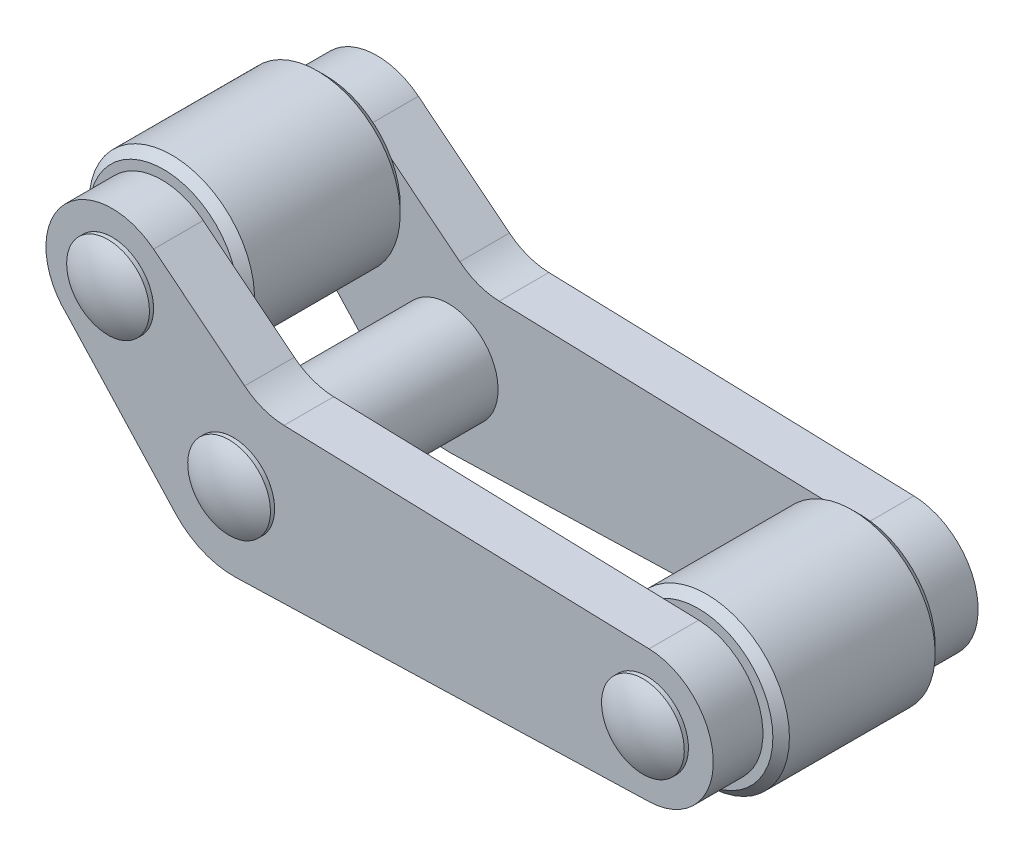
ISO-10303-21;
HEADER;
FILE_DESCRIPTION(('STEP AP214'),'2;1');
FILE_NAME('part.step','',(''),(''),'','','');
FILE_SCHEMA(('AUTOMOTIVE_DESIGN { 1 0 10303 214 1 1 1 1 }'));
ENDSEC;
DATA;
#1=APPLICATION_CONTEXT('core data for automotive mechanical design processes');
#2=APPLICATION_PROTOCOL_DEFINITION('international standard','automotive_design',2000,#1);
#3=PRODUCT_CONTEXT('',#1,'mechanical');
#4=PRODUCT('Part','Part','',(#3));
#5=PRODUCT_RELATED_PRODUCT_CATEGORY('part','',(#4));
#6=PRODUCT_DEFINITION_FORMATION('','',#4);
#7=PRODUCT_DEFINITION_CONTEXT('part definition',#1,'design');
#8=PRODUCT_DEFINITION('design','',#6,#7);
#9=PRODUCT_DEFINITION_SHAPE('','',#8);
#10=(LENGTH_UNIT() NAMED_UNIT(*) SI_UNIT(.MILLI.,.METRE.));
#11=(NAMED_UNIT(*) PLANE_ANGLE_UNIT() SI_UNIT($,.RADIAN.));
#12=(NAMED_UNIT(*) SI_UNIT($,.STERADIAN.) SOLID_ANGLE_UNIT());
#13=UNCERTAINTY_MEASURE_WITH_UNIT(LENGTH_MEASURE(1.E-05),#10,'distance_accuracy_value','');
#14=(GEOMETRIC_REPRESENTATION_CONTEXT(3) GLOBAL_UNCERTAINTY_ASSIGNED_CONTEXT((#13)) GLOBAL_UNIT_ASSIGNED_CONTEXT((#10,
#11,#12)) REPRESENTATION_CONTEXT('',''));
#15=CARTESIAN_POINT('',(0.,0.,0.));
#16=DIRECTION('',(0.,0.,1.));
#17=DIRECTION('',(1.,0.,0.));
#18=AXIS2_PLACEMENT_3D('',#15,#16,#17);
#19=CARTESIAN_POINT('',(11.,5.,7.99999999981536));
#20=DIRECTION('',(0.,0.,1.));
#21=DIRECTION('',(0.,1.,0.));
#22=AXIS2_PLACEMENT_3D('',#19,#20,#21);
#23=CONICAL_SURFACE('',#22,2.49999999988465,0.785398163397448);
#24=CARTESIAN_POINT('',(11.,5.,7.99999999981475));
#25=DIRECTION('',(0.,0.,1.));
#26=DIRECTION('',(0.,1.,0.));
#27=AXIS2_PLACEMENT_3D('',#24,#25,#26);
#28=CIRCLE('',#27,2.49999999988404);
#29=CARTESIAN_POINT('',(10.9999999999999,7.49999999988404,7.99999999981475));
#30=VERTEX_POINT('',#29);
#31=EDGE_CURVE('P0_E19',#30,#30,#28,.T.);
#32=ORIENTED_EDGE('',*,*,#31,.T.);
#33=EDGE_LOOP('',(#32));
#34=FACE_BOUND('',#33,.T.);
#35=CARTESIAN_POINT('',(11.,5.,7.49999999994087));
#36=DIRECTION('',(0.,0.,-1.));
#37=DIRECTION('',(-1.,0.,0.));
#38=AXIS2_PLACEMENT_3D('',#35,#36,#37);
#39=CIRCLE('',#38,2.);
#40=CARTESIAN_POINT('',(9.,4.99999999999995,7.49999999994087));
#41=VERTEX_POINT('',#40);
#42=EDGE_CURVE('P0_E137',#41,#41,#39,.T.);
#43=ORIENTED_EDGE('',*,*,#42,.T.);
#44=EDGE_LOOP('',(#43));
#45=FACE_BOUND('',#44,.T.);
#46=ADVANCED_FACE('P0_F16',(#34,#45),#23,.F.);
#47=CARTESIAN_POINT('',(-14.,5.,7.99999999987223));
#48=DIRECTION('',(0.,0.,1.));
#49=DIRECTION('',(0.,1.,0.));
#50=AXIS2_PLACEMENT_3D('',#47,#48,#49);
#51=CONICAL_SURFACE('',#50,2.49999999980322,0.785398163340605);
#52=CARTESIAN_POINT('',(-14.,5.,7.49999999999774));
#53=DIRECTION('',(0.,0.,-1.));
#54=DIRECTION('',(-1.,0.,0.));
#55=AXIS2_PLACEMENT_3D('',#52,#53,#54);
#56=CIRCLE('',#55,2.);
#57=CARTESIAN_POINT('',(-16.,4.99999999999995,7.49999999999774));
#58=VERTEX_POINT('',#57);
#59=EDGE_CURVE('P0_E134',#58,#58,#56,.T.);
#60=ORIENTED_EDGE('',*,*,#59,.T.);
#61=EDGE_LOOP('',(#60));
#62=FACE_BOUND('',#61,.T.);
#63=CARTESIAN_POINT('',(-14.,5.,7.99999999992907));
#64=DIRECTION('',(0.,0.,1.));
#65=DIRECTION('',(0.,1.,0.));
#66=AXIS2_PLACEMENT_3D('',#63,#64,#65);
#67=CIRCLE('',#66,2.49999999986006);
#68=CARTESIAN_POINT('',(-14.0000000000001,7.49999999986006,7.99999999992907));
#69=VERTEX_POINT('',#68);
#70=EDGE_CURVE('P0_E164',#69,#69,#67,.T.);
#71=ORIENTED_EDGE('',*,*,#70,.T.);
#72=EDGE_LOOP('',(#71));
#73=FACE_BOUND('',#72,.T.);
#74=ADVANCED_FACE('P0_F186',(#62,#73),#51,.F.);
#75=CARTESIAN_POINT('',(-21.3135370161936,11.8199836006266,7.99999999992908));
#76=DIRECTION('',(0.,0.,1.));
#77=DIRECTION('',(1.,0.,0.));
#78=AXIS2_PLACEMENT_3D('',#75,#76,#77);
#79=CONICAL_SURFACE('',#78,2.49999999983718,0.785398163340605);
#80=CARTESIAN_POINT('',(-21.3135370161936,11.8199836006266,7.49999999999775));
#81=DIRECTION('',(0.,0.,-1.));
#82=DIRECTION('',(-1.,0.,0.));
#83=AXIS2_PLACEMENT_3D('',#80,#81,#82);
#84=CIRCLE('',#83,2.);
#85=CARTESIAN_POINT('',(-23.3135370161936,11.8199836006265,7.49999999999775));
#86=VERTEX_POINT('',#85);
#87=EDGE_CURVE('P0_E97',#86,#86,#84,.T.);
#88=ORIENTED_EDGE('',*,*,#87,.T.);
#89=EDGE_LOOP('',(#88));
#90=FACE_BOUND('',#89,.T.);
#91=CARTESIAN_POINT('',(-21.3135370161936,11.8199836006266,7.99999999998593));
#92=DIRECTION('',(0.,0.,1.));
#93=DIRECTION('',(1.,0.,0.));
#94=AXIS2_PLACEMENT_3D('',#91,#92,#93);
#95=CIRCLE('',#94,2.49999999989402);
#96=CARTESIAN_POINT('',(-18.8135370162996,11.8199836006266,7.99999999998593));
#97=VERTEX_POINT('',#96);
#98=EDGE_CURVE('P0_E139',#97,#97,#95,.T.);
#99=ORIENTED_EDGE('',*,*,#98,.T.);
#100=EDGE_LOOP('',(#99));
#101=FACE_BOUND('',#100,.T.);
#102=ADVANCED_FACE('P0_F175',(#90,#101),#79,.F.);
#103=CARTESIAN_POINT('',(11.,5.,8.));
#104=DIRECTION('',(0.,0.,-1.));
#105=DIRECTION('',(-1.,0.,0.));
#106=AXIS2_PLACEMENT_3D('',#103,#104,#105);
#107=PLANE('',#106);
#108=ORIENTED_EDGE('',*,*,#98,.F.);
#109=EDGE_LOOP('',(#108));
#110=FACE_BOUND('',#109,.T.);
#111=ORIENTED_EDGE('',*,*,#70,.F.);
#112=EDGE_LOOP('',(#111));
#113=FACE_BOUND('',#112,.T.);
#114=ORIENTED_EDGE('',*,*,#31,.F.);
#115=EDGE_LOOP('',(#114));
#116=FACE_BOUND('',#115,.T.);
#117=CARTESIAN_POINT('',(-10.8128359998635,13.6582821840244,8.));
#118=DIRECTION('',(0.,0.,-1.));
#119=DIRECTION('',(-1.,0.,0.));
#120=AXIS2_PLACEMENT_3D('',#117,#118,#119);
#121=CIRCLE('',#120,3.99999999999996);
#122=CARTESIAN_POINT('',(-10.9328359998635,9.66008258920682,8.));
#123=VERTEX_POINT('',#122);
#124=CARTESIAN_POINT('',(-13.3137400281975,10.5365072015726,8.));
#125=VERTEX_POINT('',#124);
#126=EDGE_CURVE('P0_E82',#123,#125,#121,.T.);
#127=ORIENTED_EDGE('',*,*,#126,.T.);
#128=DIRECTION('',(0.780443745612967,-0.625226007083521,0.));
#129=VECTOR('',#128,1.);
#130=CARTESIAN_POINT('',(-18.8126329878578,14.9417585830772,8.));
#131=LINE('',#130,#129);
#132=CARTESIAN_POINT('',(-18.8126329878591,14.9417585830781,8.));
#133=VERTEX_POINT('',#132);
#134=EDGE_CURVE('P0_E120',#133,#125,#131,.T.);
#135=ORIENTED_EDGE('',*,*,#134,.F.);
#136=CARTESIAN_POINT('',(-21.3135370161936,11.8199836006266,8.));
#137=DIRECTION('',(0.,0.,-1.));
#138=DIRECTION('',(-1.,0.,0.));
#139=AXIS2_PLACEMENT_3D('',#136,#137,#138);
#140=CIRCLE('',#139,3.99999999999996);
#141=CARTESIAN_POINT('',(-24.0415304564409,8.89456879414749,8.));
#142=VERTEX_POINT('',#141);
#143=EDGE_CURVE('P0_E122',#142,#133,#140,.T.);
#144=ORIENTED_EDGE('',*,*,#143,.F.);
#145=DIRECTION('',(-0.677287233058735,0.735718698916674,0.));
#146=VECTOR('',#145,1.);
#147=CARTESIAN_POINT('',(-24.0415304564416,8.89456879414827,8.));
#148=LINE('',#147,#146);
#149=CARTESIAN_POINT('',(-17.4946638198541,1.78288564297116,8.));
#150=VERTEX_POINT('',#149);
#151=EDGE_CURVE('P0_E123',#150,#142,#148,.T.);
#152=ORIENTED_EDGE('',*,*,#151,.F.);
#153=CARTESIAN_POINT('',(-14.,5.,8.));
#154=DIRECTION('',(0.,0.,-1.));
#155=DIRECTION('',(-1.,0.,0.));
#156=AXIS2_PLACEMENT_3D('',#153,#154,#155);
#157=CIRCLE('',#156,4.74999999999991);
#158=CARTESIAN_POINT('',(-13.8575,0.252137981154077,8.));
#159=VERTEX_POINT('',#158);
#160=EDGE_CURVE('P0_E160',#159,#150,#157,.T.);
#161=ORIENTED_EDGE('',*,*,#160,.F.);
#162=DIRECTION('',(-0.999549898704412,-0.03,0.));
#163=VECTOR('',#162,1.);
#164=CARTESIAN_POINT('',(11.12,1.00180040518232,8.));
#165=LINE('',#164,#163);
#166=CARTESIAN_POINT('',(11.12,1.00180040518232,8.));
#167=VERTEX_POINT('',#166);
#168=EDGE_CURVE('P0_E128',#167,#159,#165,.T.);
#169=ORIENTED_EDGE('',*,*,#168,.F.);
#170=CARTESIAN_POINT('',(11.,5.,8.));
#171=DIRECTION('',(0.,0.,-1.));
#172=DIRECTION('',(-1.,0.,0.));
#173=AXIS2_PLACEMENT_3D('',#170,#171,#172);
#174=CIRCLE('',#173,3.99999999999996);
#175=CARTESIAN_POINT('',(11.1200000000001,8.99819959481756,8.));
#176=VERTEX_POINT('',#175);
#177=EDGE_CURVE('P0_E85',#176,#167,#174,.T.);
#178=ORIENTED_EDGE('',*,*,#177,.F.);
#179=DIRECTION('',(0.999549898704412,-0.030000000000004,0.));
#180=VECTOR('',#179,1.);
#181=CARTESIAN_POINT('',(11.1200000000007,8.9981995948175,8.));
#182=LINE('',#181,#180);
#183=EDGE_CURVE('P0_E79',#123,#176,#182,.T.);
#184=ORIENTED_EDGE('',*,*,#183,.F.);
#185=EDGE_LOOP('',(#127,#135,#144,#152,#161,#169,#178,#184));
#186=FACE_BOUND('',#185,.T.);
#187=ADVANCED_FACE('P0_F81',(#110,#113,#116,#186),#107,.F.);
#188=CARTESIAN_POINT('',(11.,5.,8.));
#189=DIRECTION('',(0.,0.,-1.));
#190=DIRECTION('',(-1.,0.,0.));
#191=AXIS2_PLACEMENT_3D('',#188,#189,#190);
#192=CYLINDRICAL_SURFACE('',#191,2.);
#193=ORIENTED_EDGE('',*,*,#42,.F.);
#194=EDGE_LOOP('',(#193));
#195=FACE_BOUND('',#194,.T.);
#196=CARTESIAN_POINT('',(11.,5.,5.50000000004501));
#197=DIRECTION('',(0.,0.,-1.));
#198=DIRECTION('',(-1.,0.,0.));
#199=AXIS2_PLACEMENT_3D('',#196,#197,#198);
#200=CIRCLE('',#199,1.99999999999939);
#201=CARTESIAN_POINT('',(9.00000000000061,4.99999999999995,5.50000000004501));
#202=VERTEX_POINT('',#201);
#203=EDGE_CURVE('P0_E116',#202,#202,#200,.T.);
#204=ORIENTED_EDGE('',*,*,#203,.T.);
#205=EDGE_LOOP('',(#204));
#206=FACE_BOUND('',#205,.T.);
#207=ADVANCED_FACE('P0_F174',(#195,#206),#192,.F.);
#208=CARTESIAN_POINT('',(-14.,5.,8.));
#209=DIRECTION('',(0.,0.,-1.));
#210=DIRECTION('',(-1.,0.,0.));
#211=AXIS2_PLACEMENT_3D('',#208,#209,#210);
#212=CYLINDRICAL_SURFACE('',#211,2.);
#213=ORIENTED_EDGE('',*,*,#59,.F.);
#214=EDGE_LOOP('',(#213));
#215=FACE_BOUND('',#214,.T.);
#216=CARTESIAN_POINT('',(-14.,5.,5.49999999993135));
#217=DIRECTION('',(0.,0.,-1.));
#218=DIRECTION('',(-1.,0.,0.));
#219=AXIS2_PLACEMENT_3D('',#216,#217,#218);
#220=CIRCLE('',#219,1.99999999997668);
#221=CARTESIAN_POINT('',(-15.9999999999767,4.99999999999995,5.49999999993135));
#222=VERTEX_POINT('',#221);
#223=EDGE_CURVE('P0_E113',#222,#222,#220,.T.);
#224=ORIENTED_EDGE('',*,*,#223,.T.);
#225=EDGE_LOOP('',(#224));
#226=FACE_BOUND('',#225,.T.);
#227=ADVANCED_FACE('P0_F183',(#215,#226),#212,.F.);
#228=CARTESIAN_POINT('',(-21.3135370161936,11.8199836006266,8.));
#229=DIRECTION('',(0.,0.,-1.));
#230=DIRECTION('',(-1.,0.,0.));
#231=AXIS2_PLACEMENT_3D('',#228,#229,#230);
#232=CYLINDRICAL_SURFACE('',#231,2.);
#233=ORIENTED_EDGE('',*,*,#87,.F.);
#234=EDGE_LOOP('',(#233));
#235=FACE_BOUND('',#234,.T.);
#236=CARTESIAN_POINT('',(-21.3135370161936,11.8199836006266,5.4999999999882));
#237=DIRECTION('',(0.,0.,-1.));
#238=DIRECTION('',(-1.,0.,0.));
#239=AXIS2_PLACEMENT_3D('',#236,#237,#238);
#240=CIRCLE('',#239,1.99999999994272);
#241=CARTESIAN_POINT('',(-23.3135370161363,11.8199836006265,5.4999999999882));
#242=VERTEX_POINT('',#241);
#243=EDGE_CURVE('P0_E109',#242,#242,#240,.T.);
#244=ORIENTED_EDGE('',*,*,#243,.T.);
#245=EDGE_LOOP('',(#244));
#246=FACE_BOUND('',#245,.T.);
#247=ADVANCED_FACE('P0_F239',(#235,#246),#232,.F.);
#248=CARTESIAN_POINT('',(-10.8128359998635,13.6582821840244,8.));
#249=DIRECTION('',(0.,0.,-1.));
#250=DIRECTION('',(-1.,0.,0.));
#251=AXIS2_PLACEMENT_3D('',#248,#249,#250);
#252=CYLINDRICAL_SURFACE('',#251,3.99999999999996);
#253=ORIENTED_EDGE('',*,*,#126,.F.);
#254=DIRECTION('',(0.,0.,-1.));
#255=VECTOR('',#254,1.);
#256=CARTESIAN_POINT('',(-10.9328359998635,9.66008258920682,8.));
#257=LINE('',#256,#255);
#258=CARTESIAN_POINT('',(-10.9328359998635,9.66008258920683,5.));
#259=VERTEX_POINT('',#258);
#260=EDGE_CURVE('P0_E89',#259,#123,#257,.F.);
#261=ORIENTED_EDGE('',*,*,#260,.F.);
#262=CARTESIAN_POINT('',(-10.8128359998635,13.6582821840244,5.));
#263=DIRECTION('',(0.,0.,-1.));
#264=DIRECTION('',(-1.,0.,0.));
#265=AXIS2_PLACEMENT_3D('',#262,#263,#264);
#266=CIRCLE('',#265,3.99999999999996);
#267=CARTESIAN_POINT('',(-13.3137400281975,10.5365072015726,5.));
#268=VERTEX_POINT('',#267);
#269=EDGE_CURVE('P0_E112',#268,#259,#266,.F.);
#270=ORIENTED_EDGE('',*,*,#269,.F.);
#271=DIRECTION('',(0.,0.,-1.));
#272=VECTOR('',#271,1.);
#273=CARTESIAN_POINT('',(-13.3137400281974,10.5365072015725,8.));
#274=LINE('',#273,#272);
#275=EDGE_CURVE('P0_E95',#125,#268,#274,.T.);
#276=ORIENTED_EDGE('',*,*,#275,.F.);
#277=EDGE_LOOP('',(#253,#261,#270,#276));
#278=FACE_BOUND('',#277,.T.);
#279=ADVANCED_FACE('P0_F92',(#278),#252,.F.);
#280=CARTESIAN_POINT('',(11.1200000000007,8.9981995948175,8.));
#281=DIRECTION('',(0.030000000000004,0.999549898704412,0.));
#282=DIRECTION('',(0.999549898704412,-0.030000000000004,0.));
#283=AXIS2_PLACEMENT_3D('',#280,#281,#282);
#284=PLANE('',#283);
#285=DIRECTION('',(0.999549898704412,-0.0300000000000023,0.));
#286=VECTOR('',#285,1.);
#287=CARTESIAN_POINT('',(-10.9328359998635,9.66008258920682,5.));
#288=LINE('',#287,#286);
#289=CARTESIAN_POINT('',(11.1200000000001,8.99819959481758,5.));
#290=VERTEX_POINT('',#289);
#291=EDGE_CURVE('P0_E101',#259,#290,#288,.T.);
#292=ORIENTED_EDGE('',*,*,#291,.F.);
#293=ORIENTED_EDGE('',*,*,#260,.T.);
#294=ORIENTED_EDGE('',*,*,#183,.T.);
#295=DIRECTION('',(0.,0.,-1.));
#296=VECTOR('',#295,1.);
#297=CARTESIAN_POINT('',(11.1200000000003,8.99819959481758,8.));
#298=LINE('',#297,#296);
#299=EDGE_CURVE('P0_E104',#290,#176,#298,.F.);
#300=ORIENTED_EDGE('',*,*,#299,.F.);
#301=EDGE_LOOP('',(#292,#293,#294,#300));
#302=FACE_BOUND('',#301,.T.);
#303=ADVANCED_FACE('P0_F99',(#302),#284,.T.);
#304=CARTESIAN_POINT('',(11.,5.,8.));
#305=DIRECTION('',(0.,0.,-1.));
#306=DIRECTION('',(-1.,0.,0.));
#307=AXIS2_PLACEMENT_3D('',#304,#305,#306);
#308=CYLINDRICAL_SURFACE('',#307,3.99999999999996);
#309=CARTESIAN_POINT('',(11.,5.,5.));
#310=DIRECTION('',(0.,0.,-1.));
#311=DIRECTION('',(-1.,0.,0.));
#312=AXIS2_PLACEMENT_3D('',#309,#310,#311);
#313=CIRCLE('',#312,3.99999999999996);
#314=CARTESIAN_POINT('',(11.12,1.00180040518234,5.));
#315=VERTEX_POINT('',#314);
#316=EDGE_CURVE('P0_E153',#290,#315,#313,.T.);
#317=ORIENTED_EDGE('',*,*,#316,.F.);
#318=ORIENTED_EDGE('',*,*,#299,.T.);
#319=ORIENTED_EDGE('',*,*,#177,.T.);
#320=DIRECTION('',(0.,0.,-1.));
#321=VECTOR('',#320,1.);
#322=CARTESIAN_POINT('',(11.12,1.00180040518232,8.));
#323=LINE('',#322,#321);
#324=EDGE_CURVE('P0_E130',#315,#167,#323,.F.);
#325=ORIENTED_EDGE('',*,*,#324,.F.);
#326=EDGE_LOOP('',(#317,#318,#319,#325));
#327=FACE_BOUND('',#326,.T.);
#328=ADVANCED_FACE('P0_F230',(#327),#308,.T.);
#329=CARTESIAN_POINT('',(11.12,1.00180040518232,8.));
#330=DIRECTION('',(0.03,-0.999549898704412,0.));
#331=DIRECTION('',(-0.999549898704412,-0.03,0.));
#332=AXIS2_PLACEMENT_3D('',#329,#330,#331);
#333=PLANE('',#332);
#334=DIRECTION('',(-0.999549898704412,-0.0299999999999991,0.));
#335=VECTOR('',#334,1.);
#336=CARTESIAN_POINT('',(11.12,1.00180040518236,5.));
#337=LINE('',#336,#335);
#338=CARTESIAN_POINT('',(-13.8575,0.252137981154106,5.));
#339=VERTEX_POINT('',#338);
#340=EDGE_CURVE('P0_E152',#315,#339,#337,.T.);
#341=ORIENTED_EDGE('',*,*,#340,.F.);
#342=ORIENTED_EDGE('',*,*,#324,.T.);
#343=ORIENTED_EDGE('',*,*,#168,.T.);
#344=DIRECTION('',(0.,0.,-1.));
#345=VECTOR('',#344,1.);
#346=CARTESIAN_POINT('',(-13.8575,0.252137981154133,8.));
#347=LINE('',#346,#345);
#348=EDGE_CURVE('P0_E127',#339,#159,#347,.F.);
#349=ORIENTED_EDGE('',*,*,#348,.F.);
#350=EDGE_LOOP('',(#341,#342,#343,#349));
#351=FACE_BOUND('',#350,.T.);
#352=ADVANCED_FACE('P0_F226',(#351),#333,.T.);
#353=CARTESIAN_POINT('',(-14.,5.,8.));
#354=DIRECTION('',(0.,0.,-1.));
#355=DIRECTION('',(-1.,0.,0.));
#356=AXIS2_PLACEMENT_3D('',#353,#354,#355);
#357=CYLINDRICAL_SURFACE('',#356,4.74999999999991);
#358=CARTESIAN_POINT('',(-14.,5.,5.));
#359=DIRECTION('',(0.,0.,-1.));
#360=DIRECTION('',(-1.,0.,0.));
#361=AXIS2_PLACEMENT_3D('',#358,#359,#360);
#362=CIRCLE('',#361,4.74999999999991);
#363=CARTESIAN_POINT('',(-17.4946638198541,1.78288564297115,5.));
#364=VERTEX_POINT('',#363);
#365=EDGE_CURVE('P0_E149',#339,#364,#362,.T.);
#366=ORIENTED_EDGE('',*,*,#365,.F.);
#367=ORIENTED_EDGE('',*,*,#348,.T.);
#368=ORIENTED_EDGE('',*,*,#160,.T.);
#369=DIRECTION('',(0.,0.,-1.));
#370=VECTOR('',#369,1.);
#371=CARTESIAN_POINT('',(-17.4946638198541,1.78288564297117,8.));
#372=LINE('',#371,#370);
#373=EDGE_CURVE('P0_E126',#364,#150,#372,.F.);
#374=ORIENTED_EDGE('',*,*,#373,.F.);
#375=EDGE_LOOP('',(#366,#367,#368,#374));
#376=FACE_BOUND('',#375,.T.);
#377=ADVANCED_FACE('P0_F222',(#376),#357,.T.);
#378=CARTESIAN_POINT('',(-24.0415304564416,8.89456879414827,8.));
#379=DIRECTION('',(-0.735718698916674,-0.677287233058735,0.));
#380=DIRECTION('',(-0.677287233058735,0.735718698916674,0.));
#381=AXIS2_PLACEMENT_3D('',#378,#379,#380);
#382=PLANE('',#381);
#383=DIRECTION('',(-0.677287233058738,0.73571869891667,0.));
#384=VECTOR('',#383,1.);
#385=CARTESIAN_POINT('',(-17.4946638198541,1.78288564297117,5.));
#386=LINE('',#385,#384);
#387=CARTESIAN_POINT('',(-24.0415304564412,8.89456879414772,5.));
#388=VERTEX_POINT('',#387);
#389=EDGE_CURVE('P0_E148',#364,#388,#386,.T.);
#390=ORIENTED_EDGE('',*,*,#389,.F.);
#391=ORIENTED_EDGE('',*,*,#373,.T.);
#392=ORIENTED_EDGE('',*,*,#151,.T.);
#393=DIRECTION('',(0.,0.,-1.));
#394=VECTOR('',#393,1.);
#395=CARTESIAN_POINT('',(-24.0415304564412,8.89456879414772,8.));
#396=LINE('',#395,#394);
#397=EDGE_CURVE('P0_E159',#388,#142,#396,.F.);
#398=ORIENTED_EDGE('',*,*,#397,.F.);
#399=EDGE_LOOP('',(#390,#391,#392,#398));
#400=FACE_BOUND('',#399,.T.);
#401=ADVANCED_FACE('P0_F218',(#400),#382,.T.);
#402=CARTESIAN_POINT('',(-21.3135370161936,11.8199836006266,8.));
#403=DIRECTION('',(0.,0.,-1.));
#404=DIRECTION('',(-1.,0.,0.));
#405=AXIS2_PLACEMENT_3D('',#402,#403,#404);
#406=CYLINDRICAL_SURFACE('',#405,3.99999999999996);
#407=DIRECTION('',(0.,0.,-1.));
#408=VECTOR('',#407,1.);
#409=CARTESIAN_POINT('',(-18.8126329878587,14.9417585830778,8.));
#410=LINE('',#409,#408);
#411=CARTESIAN_POINT('',(-18.8126329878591,14.9417585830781,5.));
#412=VERTEX_POINT('',#411);
#413=EDGE_CURVE('P0_E119',#412,#133,#410,.F.);
#414=ORIENTED_EDGE('',*,*,#413,.F.);
#415=CARTESIAN_POINT('',(-21.3135370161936,11.8199836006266,5.));
#416=DIRECTION('',(0.,0.,-1.));
#417=DIRECTION('',(-1.,0.,0.));
#418=AXIS2_PLACEMENT_3D('',#415,#416,#417);
#419=CIRCLE('',#418,3.99999999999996);
#420=EDGE_CURVE('P0_E34',#388,#412,#419,.T.);
#421=ORIENTED_EDGE('',*,*,#420,.F.);
#422=ORIENTED_EDGE('',*,*,#397,.T.);
#423=ORIENTED_EDGE('',*,*,#143,.T.);
#424=EDGE_LOOP('',(#414,#421,#422,#423));
#425=FACE_BOUND('',#424,.T.);
#426=ADVANCED_FACE('P0_F214',(#425),#406,.T.);
#427=CARTESIAN_POINT('',(-18.8126329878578,14.9417585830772,8.));
#428=DIRECTION('',(0.625226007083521,0.780443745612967,0.));
#429=DIRECTION('',(0.780443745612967,-0.625226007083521,0.));
#430=AXIS2_PLACEMENT_3D('',#427,#428,#429);
#431=PLANE('',#430);
#432=DIRECTION('',(0.780443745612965,-0.625226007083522,0.));
#433=VECTOR('',#432,1.);
#434=CARTESIAN_POINT('',(-18.8126329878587,14.9417585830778,5.));
#435=LINE('',#434,#433);
#436=EDGE_CURVE('P0_E146',#412,#268,#435,.T.);
#437=ORIENTED_EDGE('',*,*,#436,.F.);
#438=ORIENTED_EDGE('',*,*,#413,.T.);
#439=ORIENTED_EDGE('',*,*,#134,.T.);
#440=ORIENTED_EDGE('',*,*,#275,.T.);
#441=EDGE_LOOP('',(#437,#438,#439,#440));
#442=FACE_BOUND('',#441,.T.);
#443=ADVANCED_FACE('P0_F210',(#442),#431,.T.);
#444=CARTESIAN_POINT('',(11.,5.,5.00000000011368));
#445=DIRECTION('',(0.,0.,-1.));
#446=DIRECTION('',(-1.,0.,0.));
#447=AXIS2_PLACEMENT_3D('',#444,#445,#446);
#448=CONICAL_SURFACE('',#447,2.49999999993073,0.785398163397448);
#449=ORIENTED_EDGE('',*,*,#203,.F.);
#450=EDGE_LOOP('',(#449));
#451=FACE_BOUND('',#450,.T.);
#452=CARTESIAN_POINT('',(11.,5.,5.00000000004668));
#453=DIRECTION('',(0.,0.,-1.));
#454=DIRECTION('',(-1.,0.,0.));
#455=AXIS2_PLACEMENT_3D('',#452,#453,#454);
#456=CIRCLE('',#455,2.49999999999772);
#457=CARTESIAN_POINT('',(8.50000000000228,4.99999999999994,5.00000000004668));
#458=VERTEX_POINT('',#457);
#459=EDGE_CURVE('P0_E143',#458,#458,#456,.F.);
#460=ORIENTED_EDGE('',*,*,#459,.F.);
#461=EDGE_LOOP('',(#460));
#462=FACE_BOUND('',#461,.T.);
#463=ADVANCED_FACE('P0_F206',(#451,#462),#448,.F.);
#464=CARTESIAN_POINT('',(-14.,5.,5.0000000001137));
#465=DIRECTION('',(0.,0.,-1.));
#466=DIRECTION('',(-1.,0.,0.));
#467=AXIS2_PLACEMENT_3D('',#464,#465,#466);
#468=CONICAL_SURFACE('',#467,2.49999999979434,0.785398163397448);
#469=ORIENTED_EDGE('',*,*,#223,.F.);
#470=EDGE_LOOP('',(#469));
#471=FACE_BOUND('',#470,.T.);
#472=CARTESIAN_POINT('',(-14.,5.,5.00000000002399));
#473=DIRECTION('',(0.,0.,-1.));
#474=DIRECTION('',(-1.,0.,0.));
#475=AXIS2_PLACEMENT_3D('',#472,#473,#474);
#476=CIRCLE('',#475,2.49999999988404);
#477=CARTESIAN_POINT('',(-16.499999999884,4.99999999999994,5.00000000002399));
#478=VERTEX_POINT('',#477);
#479=EDGE_CURVE('P0_E25',#478,#478,#476,.F.);
#480=ORIENTED_EDGE('',*,*,#479,.F.);
#481=EDGE_LOOP('',(#480));
#482=FACE_BOUND('',#481,.T.);
#483=ADVANCED_FACE('P0_F199',(#471,#482),#468,.F.);
#484=CARTESIAN_POINT('',(-21.3135370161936,11.8199836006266,5.00000000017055));
#485=DIRECTION('',(0.,0.,-1.));
#486=DIRECTION('',(-1.,0.,0.));
#487=AXIS2_PLACEMENT_3D('',#484,#485,#486);
#488=CONICAL_SURFACE('',#487,2.49999999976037,0.785398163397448);
#489=ORIENTED_EDGE('',*,*,#243,.F.);
#490=EDGE_LOOP('',(#489));
#491=FACE_BOUND('',#490,.T.);
#492=CARTESIAN_POINT('',(-21.3135370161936,11.8199836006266,5.00000000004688));
#493=DIRECTION('',(0.,0.,-1.));
#494=DIRECTION('',(-1.,0.,0.));
#495=AXIS2_PLACEMENT_3D('',#492,#493,#494);
#496=CIRCLE('',#495,2.49999999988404);
#497=CARTESIAN_POINT('',(-23.8135370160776,11.8199836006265,5.00000000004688));
#498=VERTEX_POINT('',#497);
#499=EDGE_CURVE('P0_E10',#498,#498,#496,.F.);
#500=ORIENTED_EDGE('',*,*,#499,.F.);
#501=EDGE_LOOP('',(#500));
#502=FACE_BOUND('',#501,.T.);
#503=ADVANCED_FACE('P0_F193',(#491,#502),#488,.F.);
#504=CARTESIAN_POINT('',(11.,5.,5.));
#505=DIRECTION('',(0.,0.,-1.));
#506=DIRECTION('',(-1.,0.,0.));
#507=AXIS2_PLACEMENT_3D('',#504,#505,#506);
#508=PLANE('',#507);
#509=ORIENTED_EDGE('',*,*,#499,.T.);
#510=EDGE_LOOP('',(#509));
#511=FACE_BOUND('',#510,.T.);
#512=ORIENTED_EDGE('',*,*,#479,.T.);
#513=EDGE_LOOP('',(#512));
#514=FACE_BOUND('',#513,.T.);
#515=ORIENTED_EDGE('',*,*,#459,.T.);
#516=EDGE_LOOP('',(#515));
#517=FACE_BOUND('',#516,.T.);
#518=ORIENTED_EDGE('',*,*,#420,.T.);
#519=ORIENTED_EDGE('',*,*,#436,.T.);
#520=ORIENTED_EDGE('',*,*,#269,.T.);
#521=ORIENTED_EDGE('',*,*,#291,.T.);
#522=ORIENTED_EDGE('',*,*,#316,.T.);
#523=ORIENTED_EDGE('',*,*,#340,.T.);
#524=ORIENTED_EDGE('',*,*,#365,.T.);
#525=ORIENTED_EDGE('',*,*,#389,.T.);
#526=EDGE_LOOP('',(#518,#519,#520,#521,#522,#523,#524,#525));
#527=FACE_BOUND('',#526,.T.);
#528=ADVANCED_FACE('P0_F191',(#511,#514,#517,#527),#508,.T.);
#529=CLOSED_SHELL('',(#46,#74,#102,#187,#207,#227,#247,#279,#303,#328,#352,#377,#401,#426,#443,
#463,#483,#503,#528));
#530=MANIFOLD_SOLID_BREP('P0_B1',#529);
#531=CARTESIAN_POINT('',(11.,5.,-5.00000000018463));
#532=DIRECTION('',(0.,0.,1.));
#533=DIRECTION('',(0.,1.,0.));
#534=AXIS2_PLACEMENT_3D('',#531,#532,#533);
#535=CONICAL_SURFACE('',#534,2.49999999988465,0.785398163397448);
#536=CARTESIAN_POINT('',(11.,5.,-5.00000000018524));
#537=DIRECTION('',(0.,0.,1.));
#538=DIRECTION('',(0.,1.,0.));
#539=AXIS2_PLACEMENT_3D('',#536,#537,#538);
#540=CIRCLE('',#539,2.49999999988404);
#541=CARTESIAN_POINT('',(10.9999999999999,7.49999999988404,-5.00000000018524));
#542=VERTEX_POINT('',#541);
#543=EDGE_CURVE('P1_E20',#542,#542,#540,.T.);
#544=ORIENTED_EDGE('',*,*,#543,.T.);
#545=EDGE_LOOP('',(#544));
#546=FACE_BOUND('',#545,.T.);
#547=CARTESIAN_POINT('',(11.,5.,-5.50000000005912));
#548=DIRECTION('',(0.,0.,-1.));
#549=DIRECTION('',(-1.,0.,0.));
#550=AXIS2_PLACEMENT_3D('',#547,#548,#549);
#551=CIRCLE('',#550,2.);
#552=CARTESIAN_POINT('',(9.,4.99999999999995,-5.50000000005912));
#553=VERTEX_POINT('',#552);
#554=EDGE_CURVE('P1_E138',#553,#553,#551,.T.);
#555=ORIENTED_EDGE('',*,*,#554,.T.);
#556=EDGE_LOOP('',(#555));
#557=FACE_BOUND('',#556,.T.);
#558=ADVANCED_FACE('P1_F17',(#546,#557),#535,.F.);
#559=CARTESIAN_POINT('',(-14.,5.,-5.00000000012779));
#560=DIRECTION('',(0.,0.,1.));
#561=DIRECTION('',(0.,1.,0.));
#562=AXIS2_PLACEMENT_3D('',#559,#560,#561);
#563=CONICAL_SURFACE('',#562,2.49999999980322,0.785398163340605);
#564=CARTESIAN_POINT('',(-14.,5.,-5.50000000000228));
#565=DIRECTION('',(0.,0.,-1.));
#566=DIRECTION('',(-1.,0.,0.));
#567=AXIS2_PLACEMENT_3D('',#564,#565,#566);
#568=CIRCLE('',#567,2.);
#569=CARTESIAN_POINT('',(-16.,4.99999999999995,-5.50000000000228));
#570=VERTEX_POINT('',#569);
#571=EDGE_CURVE('P1_E135',#570,#570,#568,.T.);
#572=ORIENTED_EDGE('',*,*,#571,.T.);
#573=EDGE_LOOP('',(#572));
#574=FACE_BOUND('',#573,.T.);
#575=CARTESIAN_POINT('',(-14.,5.,-5.00000000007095));
#576=DIRECTION('',(0.,0.,1.));
#577=DIRECTION('',(0.,1.,0.));
#578=AXIS2_PLACEMENT_3D('',#575,#576,#577);
#579=CIRCLE('',#578,2.49999999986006);
#580=CARTESIAN_POINT('',(-14.0000000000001,7.49999999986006,-5.00000000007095));
#581=VERTEX_POINT('',#580);
#582=EDGE_CURVE('P1_E165',#581,#581,#579,.T.);
#583=ORIENTED_EDGE('',*,*,#582,.T.);
#584=EDGE_LOOP('',(#583));
#585=FACE_BOUND('',#584,.T.);
#586=ADVANCED_FACE('P1_F187',(#574,#585),#563,.F.);
#587=CARTESIAN_POINT('',(-21.3135370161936,11.8199836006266,-5.00000000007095));
#588=DIRECTION('',(0.,0.,1.));
#589=DIRECTION('',(1.,0.,0.));
#590=AXIS2_PLACEMENT_3D('',#587,#588,#589);
#591=CONICAL_SURFACE('',#590,2.49999999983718,0.785398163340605);
#592=CARTESIAN_POINT('',(-21.3135370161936,11.8199836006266,-5.50000000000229));
#593=DIRECTION('',(0.,0.,-1.));
#594=DIRECTION('',(-1.,0.,0.));
#595=AXIS2_PLACEMENT_3D('',#592,#593,#594);
#596=CIRCLE('',#595,2.);
#597=CARTESIAN_POINT('',(-23.3135370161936,11.8199836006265,-5.50000000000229));
#598=VERTEX_POINT('',#597);
#599=EDGE_CURVE('P1_E98',#598,#598,#596,.T.);
#600=ORIENTED_EDGE('',*,*,#599,.T.);
#601=EDGE_LOOP('',(#600));
#602=FACE_BOUND('',#601,.T.);
#603=CARTESIAN_POINT('',(-21.3135370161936,11.8199836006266,-5.00000000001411));
#604=DIRECTION('',(0.,0.,1.));
#605=DIRECTION('',(1.,0.,0.));
#606=AXIS2_PLACEMENT_3D('',#603,#604,#605);
#607=CIRCLE('',#606,2.49999999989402);
#608=CARTESIAN_POINT('',(-18.8135370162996,11.8199836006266,-5.00000000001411));
#609=VERTEX_POINT('',#608);
#610=EDGE_CURVE('P1_E140',#609,#609,#607,.T.);
#611=ORIENTED_EDGE('',*,*,#610,.T.);
#612=EDGE_LOOP('',(#611));
#613=FACE_BOUND('',#612,.T.);
#614=ADVANCED_FACE('P1_F176',(#602,#613),#591,.F.);
#615=CARTESIAN_POINT('',(11.,5.,-5.));
#616=DIRECTION('',(0.,0.,-1.));
#617=DIRECTION('',(-1.,0.,0.));
#618=AXIS2_PLACEMENT_3D('',#615,#616,#617);
#619=PLANE('',#618);
#620=ORIENTED_EDGE('',*,*,#610,.F.);
#621=EDGE_LOOP('',(#620));
#622=FACE_BOUND('',#621,.T.);
#623=ORIENTED_EDGE('',*,*,#582,.F.);
#624=EDGE_LOOP('',(#623));
#625=FACE_BOUND('',#624,.T.);
#626=ORIENTED_EDGE('',*,*,#543,.F.);
#627=EDGE_LOOP('',(#626));
#628=FACE_BOUND('',#627,.T.);
#629=CARTESIAN_POINT('',(-10.8128359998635,13.6582821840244,-5.));
#630=DIRECTION('',(0.,0.,-1.));
#631=DIRECTION('',(-1.,0.,0.));
#632=AXIS2_PLACEMENT_3D('',#629,#630,#631);
#633=CIRCLE('',#632,3.99999999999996);
#634=CARTESIAN_POINT('',(-10.9328359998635,9.66008258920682,-5.));
#635=VERTEX_POINT('',#634);
#636=CARTESIAN_POINT('',(-13.3137400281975,10.5365072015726,-5.));
#637=VERTEX_POINT('',#636);
#638=EDGE_CURVE('P1_E83',#635,#637,#633,.T.);
#639=ORIENTED_EDGE('',*,*,#638,.T.);
#640=DIRECTION('',(0.780443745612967,-0.625226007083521,0.));
#641=VECTOR('',#640,1.);
#642=CARTESIAN_POINT('',(-18.8126329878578,14.9417585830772,-5.));
#643=LINE('',#642,#641);
#644=CARTESIAN_POINT('',(-18.8126329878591,14.9417585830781,-5.));
#645=VERTEX_POINT('',#644);
#646=EDGE_CURVE('P1_E121',#645,#637,#643,.T.);
#647=ORIENTED_EDGE('',*,*,#646,.F.);
#648=CARTESIAN_POINT('',(-21.3135370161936,11.8199836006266,-5.));
#649=DIRECTION('',(0.,0.,-1.));
#650=DIRECTION('',(-1.,0.,0.));
#651=AXIS2_PLACEMENT_3D('',#648,#649,#650);
#652=CIRCLE('',#651,3.99999999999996);
#653=CARTESIAN_POINT('',(-24.0415304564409,8.89456879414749,-5.));
#654=VERTEX_POINT('',#653);
#655=EDGE_CURVE('P1_E123',#654,#645,#652,.T.);
#656=ORIENTED_EDGE('',*,*,#655,.F.);
#657=DIRECTION('',(-0.677287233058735,0.735718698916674,0.));
#658=VECTOR('',#657,1.);
#659=CARTESIAN_POINT('',(-24.0415304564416,8.89456879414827,-5.));
#660=LINE('',#659,#658);
#661=CARTESIAN_POINT('',(-17.4946638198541,1.78288564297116,-5.));
#662=VERTEX_POINT('',#661);
#663=EDGE_CURVE('P1_E124',#662,#654,#660,.T.);
#664=ORIENTED_EDGE('',*,*,#663,.F.);
#665=CARTESIAN_POINT('',(-14.,5.,-5.));
#666=DIRECTION('',(0.,0.,-1.));
#667=DIRECTION('',(-1.,0.,0.));
#668=AXIS2_PLACEMENT_3D('',#665,#666,#667);
#669=CIRCLE('',#668,4.74999999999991);
#670=CARTESIAN_POINT('',(-13.8575,0.252137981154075,-5.));
#671=VERTEX_POINT('',#670);
#672=EDGE_CURVE('P1_E161',#671,#662,#669,.T.);
#673=ORIENTED_EDGE('',*,*,#672,.F.);
#674=DIRECTION('',(-0.999549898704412,-0.03,0.));
#675=VECTOR('',#674,1.);
#676=CARTESIAN_POINT('',(11.12,1.00180040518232,-5.));
#677=LINE('',#676,#675);
#678=CARTESIAN_POINT('',(11.12,1.00180040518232,-5.));
#679=VERTEX_POINT('',#678);
#680=EDGE_CURVE('P1_E129',#679,#671,#677,.T.);
#681=ORIENTED_EDGE('',*,*,#680,.F.);
#682=CARTESIAN_POINT('',(11.,5.,-5.));
#683=DIRECTION('',(0.,0.,-1.));
#684=DIRECTION('',(-1.,0.,0.));
#685=AXIS2_PLACEMENT_3D('',#682,#683,#684);
#686=CIRCLE('',#685,3.99999999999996);
#687=CARTESIAN_POINT('',(11.1200000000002,8.99819959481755,-5.));
#688=VERTEX_POINT('',#687);
#689=EDGE_CURVE('P1_E86',#688,#679,#686,.T.);
#690=ORIENTED_EDGE('',*,*,#689,.F.);
#691=DIRECTION('',(0.999549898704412,-0.030000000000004,0.));
#692=VECTOR('',#691,1.);
#693=CARTESIAN_POINT('',(11.1200000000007,8.9981995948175,-5.));
#694=LINE('',#693,#692);
#695=EDGE_CURVE('P1_E80',#635,#688,#694,.T.);
#696=ORIENTED_EDGE('',*,*,#695,.F.);
#697=EDGE_LOOP('',(#639,#647,#656,#664,#673,#681,#690,#696));
#698=FACE_BOUND('',#697,.T.);
#699=ADVANCED_FACE('P1_F82',(#622,#625,#628,#698),#619,.F.);
#700=CARTESIAN_POINT('',(11.,5.,-5.));
#701=DIRECTION('',(0.,0.,-1.));
#702=DIRECTION('',(-1.,0.,0.));
#703=AXIS2_PLACEMENT_3D('',#700,#701,#702);
#704=CYLINDRICAL_SURFACE('',#703,2.);
#705=ORIENTED_EDGE('',*,*,#554,.F.);
#706=EDGE_LOOP('',(#705));
#707=FACE_BOUND('',#706,.T.);
#708=CARTESIAN_POINT('',(11.,5.,-7.49999999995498));
#709=DIRECTION('',(0.,0.,-1.));
#710=DIRECTION('',(-1.,0.,0.));
#711=AXIS2_PLACEMENT_3D('',#708,#709,#710);
#712=CIRCLE('',#711,1.99999999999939);
#713=CARTESIAN_POINT('',(9.00000000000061,4.99999999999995,-7.49999999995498));
#714=VERTEX_POINT('',#713);
#715=EDGE_CURVE('P1_E117',#714,#714,#712,.T.);
#716=ORIENTED_EDGE('',*,*,#715,.T.);
#717=EDGE_LOOP('',(#716));
#718=FACE_BOUND('',#717,.T.);
#719=ADVANCED_FACE('P1_F175',(#707,#718),#704,.F.);
#720=CARTESIAN_POINT('',(-14.,5.,-5.));
#721=DIRECTION('',(0.,0.,-1.));
#722=DIRECTION('',(-1.,0.,0.));
#723=AXIS2_PLACEMENT_3D('',#720,#721,#722);
#724=CYLINDRICAL_SURFACE('',#723,2.);
#725=ORIENTED_EDGE('',*,*,#571,.F.);
#726=EDGE_LOOP('',(#725));
#727=FACE_BOUND('',#726,.T.);
#728=CARTESIAN_POINT('',(-14.,5.,-7.50000000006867));
#729=DIRECTION('',(0.,0.,-1.));
#730=DIRECTION('',(-1.,0.,0.));
#731=AXIS2_PLACEMENT_3D('',#728,#729,#730);
#732=CIRCLE('',#731,1.99999999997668);
#733=CARTESIAN_POINT('',(-15.9999999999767,4.99999999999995,-7.50000000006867));
#734=VERTEX_POINT('',#733);
#735=EDGE_CURVE('P1_E114',#734,#734,#732,.T.);
#736=ORIENTED_EDGE('',*,*,#735,.T.);
#737=EDGE_LOOP('',(#736));
#738=FACE_BOUND('',#737,.T.);
#739=ADVANCED_FACE('P1_F184',(#727,#738),#724,.F.);
#740=CARTESIAN_POINT('',(-21.3135370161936,11.8199836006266,-5.));
#741=DIRECTION('',(0.,0.,-1.));
#742=DIRECTION('',(-1.,0.,0.));
#743=AXIS2_PLACEMENT_3D('',#740,#741,#742);
#744=CYLINDRICAL_SURFACE('',#743,2.);
#745=ORIENTED_EDGE('',*,*,#599,.F.);
#746=EDGE_LOOP('',(#745));
#747=FACE_BOUND('',#746,.T.);
#748=CARTESIAN_POINT('',(-21.3135370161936,11.8199836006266,-7.50000000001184));
#749=DIRECTION('',(0.,0.,-1.));
#750=DIRECTION('',(-1.,0.,0.));
#751=AXIS2_PLACEMENT_3D('',#748,#749,#750);
#752=CIRCLE('',#751,1.99999999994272);
#753=CARTESIAN_POINT('',(-23.3135370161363,11.8199836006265,-7.50000000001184));
#754=VERTEX_POINT('',#753);
#755=EDGE_CURVE('P1_E110',#754,#754,#752,.T.);
#756=ORIENTED_EDGE('',*,*,#755,.T.);
#757=EDGE_LOOP('',(#756));
#758=FACE_BOUND('',#757,.T.);
#759=ADVANCED_FACE('P1_F240',(#747,#758),#744,.F.);
#760=CARTESIAN_POINT('',(-10.8128359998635,13.6582821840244,-5.));
#761=DIRECTION('',(0.,0.,-1.));
#762=DIRECTION('',(-1.,0.,0.));
#763=AXIS2_PLACEMENT_3D('',#760,#761,#762);
#764=CYLINDRICAL_SURFACE('',#763,3.99999999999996);
#765=ORIENTED_EDGE('',*,*,#638,.F.);
#766=DIRECTION('',(0.,0.,-1.));
#767=VECTOR('',#766,1.);
#768=CARTESIAN_POINT('',(-10.9328359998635,9.66008258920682,-5.));
#769=LINE('',#768,#767);
#770=CARTESIAN_POINT('',(-10.9328359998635,9.66008258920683,-8.));
#771=VERTEX_POINT('',#770);
#772=EDGE_CURVE('P1_E90',#771,#635,#769,.F.);
#773=ORIENTED_EDGE('',*,*,#772,.F.);
#774=CARTESIAN_POINT('',(-10.8128359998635,13.6582821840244,-8.));
#775=DIRECTION('',(0.,0.,-1.));
#776=DIRECTION('',(-1.,0.,0.));
#777=AXIS2_PLACEMENT_3D('',#774,#775,#776);
#778=CIRCLE('',#777,3.99999999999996);
#779=CARTESIAN_POINT('',(-13.3137400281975,10.5365072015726,-8.));
#780=VERTEX_POINT('',#779);
#781=EDGE_CURVE('P1_E113',#780,#771,#778,.F.);
#782=ORIENTED_EDGE('',*,*,#781,.F.);
#783=DIRECTION('',(0.,0.,-1.));
#784=VECTOR('',#783,1.);
#785=CARTESIAN_POINT('',(-13.3137400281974,10.5365072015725,-5.));
#786=LINE('',#785,#784);
#787=EDGE_CURVE('P1_E96',#637,#780,#786,.T.);
#788=ORIENTED_EDGE('',*,*,#787,.F.);
#789=EDGE_LOOP('',(#765,#773,#782,#788));
#790=FACE_BOUND('',#789,.T.);
#791=ADVANCED_FACE('P1_F93',(#790),#764,.F.);
#792=CARTESIAN_POINT('',(11.1200000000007,8.9981995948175,-5.));
#793=DIRECTION('',(0.030000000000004,0.999549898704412,0.));
#794=DIRECTION('',(0.999549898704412,-0.030000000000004,0.));
#795=AXIS2_PLACEMENT_3D('',#792,#793,#794);
#796=PLANE('',#795);
#797=DIRECTION('',(0.999549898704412,-0.0300000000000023,0.));
#798=VECTOR('',#797,1.);
#799=CARTESIAN_POINT('',(-10.9328359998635,9.66008258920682,-8.));
#800=LINE('',#799,#798);
#801=CARTESIAN_POINT('',(11.1200000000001,8.99819959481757,-8.));
#802=VERTEX_POINT('',#801);
#803=EDGE_CURVE('P1_E102',#771,#802,#800,.T.);
#804=ORIENTED_EDGE('',*,*,#803,.F.);
#805=ORIENTED_EDGE('',*,*,#772,.T.);
#806=ORIENTED_EDGE('',*,*,#695,.T.);
#807=DIRECTION('',(0.,0.,-1.));
#808=VECTOR('',#807,1.);
#809=CARTESIAN_POINT('',(11.1200000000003,8.99819959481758,-5.));
#810=LINE('',#809,#808);
#811=EDGE_CURVE('P1_E105',#802,#688,#810,.F.);
#812=ORIENTED_EDGE('',*,*,#811,.F.);
#813=EDGE_LOOP('',(#804,#805,#806,#812));
#814=FACE_BOUND('',#813,.T.);
#815=ADVANCED_FACE('P1_F100',(#814),#796,.T.);
#816=CARTESIAN_POINT('',(11.,5.,-5.));
#817=DIRECTION('',(0.,0.,-1.));
#818=DIRECTION('',(-1.,0.,0.));
#819=AXIS2_PLACEMENT_3D('',#816,#817,#818);
#820=CYLINDRICAL_SURFACE('',#819,3.99999999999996);
#821=CARTESIAN_POINT('',(11.,5.,-8.));
#822=DIRECTION('',(0.,0.,-1.));
#823=DIRECTION('',(-1.,0.,0.));
#824=AXIS2_PLACEMENT_3D('',#821,#822,#823);
#825=CIRCLE('',#824,3.99999999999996);
#826=CARTESIAN_POINT('',(11.12,1.00180040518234,-8.));
#827=VERTEX_POINT('',#826);
#828=EDGE_CURVE('P1_E154',#802,#827,#825,.T.);
#829=ORIENTED_EDGE('',*,*,#828,.F.);
#830=ORIENTED_EDGE('',*,*,#811,.T.);
#831=ORIENTED_EDGE('',*,*,#689,.T.);
#832=DIRECTION('',(0.,0.,-1.));
#833=VECTOR('',#832,1.);
#834=CARTESIAN_POINT('',(11.12,1.00180040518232,-5.));
#835=LINE('',#834,#833);
#836=EDGE_CURVE('P1_E131',#827,#679,#835,.F.);
#837=ORIENTED_EDGE('',*,*,#836,.F.);
#838=EDGE_LOOP('',(#829,#830,#831,#837));
#839=FACE_BOUND('',#838,.T.);
#840=ADVANCED_FACE('P1_F231',(#839),#820,.T.);
#841=CARTESIAN_POINT('',(11.12,1.00180040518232,-5.));
#842=DIRECTION('',(0.03,-0.999549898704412,0.));
#843=DIRECTION('',(-0.999549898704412,-0.03,0.));
#844=AXIS2_PLACEMENT_3D('',#841,#842,#843);
#845=PLANE('',#844);
#846=DIRECTION('',(-0.999549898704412,-0.0299999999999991,0.));
#847=VECTOR('',#846,1.);
#848=CARTESIAN_POINT('',(11.12,1.00180040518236,-8.));
#849=LINE('',#848,#847);
#850=CARTESIAN_POINT('',(-13.8575,0.252137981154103,-8.));
#851=VERTEX_POINT('',#850);
#852=EDGE_CURVE('P1_E153',#827,#851,#849,.T.);
#853=ORIENTED_EDGE('',*,*,#852,.F.);
#854=ORIENTED_EDGE('',*,*,#836,.T.);
#855=ORIENTED_EDGE('',*,*,#680,.T.);
#856=DIRECTION('',(0.,0.,-1.));
#857=VECTOR('',#856,1.);
#858=CARTESIAN_POINT('',(-13.8575,0.252137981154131,-5.));
#859=LINE('',#858,#857);
#860=EDGE_CURVE('P1_E128',#851,#671,#859,.F.);
#861=ORIENTED_EDGE('',*,*,#860,.F.);
#862=EDGE_LOOP('',(#853,#854,#855,#861));
#863=FACE_BOUND('',#862,.T.);
#864=ADVANCED_FACE('P1_F227',(#863),#845,.T.);
#865=CARTESIAN_POINT('',(-14.,5.,-5.));
#866=DIRECTION('',(0.,0.,-1.));
#867=DIRECTION('',(-1.,0.,0.));
#868=AXIS2_PLACEMENT_3D('',#865,#866,#867);
#869=CYLINDRICAL_SURFACE('',#868,4.74999999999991);
#870=CARTESIAN_POINT('',(-14.,5.,-8.));
#871=DIRECTION('',(0.,0.,-1.));
#872=DIRECTION('',(-1.,0.,0.));
#873=AXIS2_PLACEMENT_3D('',#870,#871,#872);
#874=CIRCLE('',#873,4.74999999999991);
#875=CARTESIAN_POINT('',(-17.4946638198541,1.78288564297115,-8.));
#876=VERTEX_POINT('',#875);
#877=EDGE_CURVE('P1_E150',#851,#876,#874,.T.);
#878=ORIENTED_EDGE('',*,*,#877,.F.);
#879=ORIENTED_EDGE('',*,*,#860,.T.);
#880=ORIENTED_EDGE('',*,*,#672,.T.);
#881=DIRECTION('',(0.,0.,-1.));
#882=VECTOR('',#881,1.);
#883=CARTESIAN_POINT('',(-17.4946638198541,1.78288564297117,-5.));
#884=LINE('',#883,#882);
#885=EDGE_CURVE('P1_E127',#876,#662,#884,.F.);
#886=ORIENTED_EDGE('',*,*,#885,.F.);
#887=EDGE_LOOP('',(#878,#879,#880,#886));
#888=FACE_BOUND('',#887,.T.);
#889=ADVANCED_FACE('P1_F223',(#888),#869,.T.);
#890=CARTESIAN_POINT('',(-24.0415304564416,8.89456879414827,-5.));
#891=DIRECTION('',(-0.735718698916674,-0.677287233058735,0.));
#892=DIRECTION('',(-0.677287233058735,0.735718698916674,0.));
#893=AXIS2_PLACEMENT_3D('',#890,#891,#892);
#894=PLANE('',#893);
#895=DIRECTION('',(-0.677287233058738,0.73571869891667,0.));
#896=VECTOR('',#895,1.);
#897=CARTESIAN_POINT('',(-17.4946638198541,1.78288564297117,-8.));
#898=LINE('',#897,#896);
#899=CARTESIAN_POINT('',(-24.0415304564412,8.89456879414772,-8.));
#900=VERTEX_POINT('',#899);
#901=EDGE_CURVE('P1_E149',#876,#900,#898,.T.);
#902=ORIENTED_EDGE('',*,*,#901,.F.);
#903=ORIENTED_EDGE('',*,*,#885,.T.);
#904=ORIENTED_EDGE('',*,*,#663,.T.);
#905=DIRECTION('',(0.,0.,-1.));
#906=VECTOR('',#905,1.);
#907=CARTESIAN_POINT('',(-24.0415304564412,8.89456879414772,-5.));
#908=LINE('',#907,#906);
#909=EDGE_CURVE('P1_E160',#900,#654,#908,.F.);
#910=ORIENTED_EDGE('',*,*,#909,.F.);
#911=EDGE_LOOP('',(#902,#903,#904,#910));
#912=FACE_BOUND('',#911,.T.);
#913=ADVANCED_FACE('P1_F219',(#912),#894,.T.);
#914=CARTESIAN_POINT('',(-21.3135370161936,11.8199836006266,-5.));
#915=DIRECTION('',(0.,0.,-1.));
#916=DIRECTION('',(-1.,0.,0.));
#917=AXIS2_PLACEMENT_3D('',#914,#915,#916);
#918=CYLINDRICAL_SURFACE('',#917,3.99999999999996);
#919=DIRECTION('',(0.,0.,-1.));
#920=VECTOR('',#919,1.);
#921=CARTESIAN_POINT('',(-18.8126329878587,14.9417585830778,-5.));
#922=LINE('',#921,#920);
#923=CARTESIAN_POINT('',(-18.8126329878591,14.9417585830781,-8.));
#924=VERTEX_POINT('',#923);
#925=EDGE_CURVE('P1_E120',#924,#645,#922,.F.);
#926=ORIENTED_EDGE('',*,*,#925,.F.);
#927=CARTESIAN_POINT('',(-21.3135370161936,11.8199836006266,-8.));
#928=DIRECTION('',(0.,0.,-1.));
#929=DIRECTION('',(-1.,0.,0.));
#930=AXIS2_PLACEMENT_3D('',#927,#928,#929);
#931=CIRCLE('',#930,3.99999999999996);
#932=EDGE_CURVE('P1_E35',#900,#924,#931,.T.);
#933=ORIENTED_EDGE('',*,*,#932,.F.);
#934=ORIENTED_EDGE('',*,*,#909,.T.);
#935=ORIENTED_EDGE('',*,*,#655,.T.);
#936=EDGE_LOOP('',(#926,#933,#934,#935));
#937=FACE_BOUND('',#936,.T.);
#938=ADVANCED_FACE('P1_F215',(#937),#918,.T.);
#939=CARTESIAN_POINT('',(-18.8126329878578,14.9417585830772,-5.));
#940=DIRECTION('',(0.625226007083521,0.780443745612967,0.));
#941=DIRECTION('',(0.780443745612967,-0.625226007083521,0.));
#942=AXIS2_PLACEMENT_3D('',#939,#940,#941);
#943=PLANE('',#942);
#944=DIRECTION('',(0.780443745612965,-0.625226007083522,0.));
#945=VECTOR('',#944,1.);
#946=CARTESIAN_POINT('',(-18.8126329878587,14.9417585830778,-8.));
#947=LINE('',#946,#945);
#948=EDGE_CURVE('P1_E147',#924,#780,#947,.T.);
#949=ORIENTED_EDGE('',*,*,#948,.F.);
#950=ORIENTED_EDGE('',*,*,#925,.T.);
#951=ORIENTED_EDGE('',*,*,#646,.T.);
#952=ORIENTED_EDGE('',*,*,#787,.T.);
#953=EDGE_LOOP('',(#949,#950,#951,#952));
#954=FACE_BOUND('',#953,.T.);
#955=ADVANCED_FACE('P1_F211',(#954),#943,.T.);
#956=CARTESIAN_POINT('',(11.,5.,-7.99999999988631));
#957=DIRECTION('',(0.,0.,-1.));
#958=DIRECTION('',(-1.,0.,0.));
#959=AXIS2_PLACEMENT_3D('',#956,#957,#958);
#960=CONICAL_SURFACE('',#959,2.49999999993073,0.785398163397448);
#961=ORIENTED_EDGE('',*,*,#715,.F.);
#962=EDGE_LOOP('',(#961));
#963=FACE_BOUND('',#962,.T.);
#964=CARTESIAN_POINT('',(11.,5.,-7.99999999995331));
#965=DIRECTION('',(0.,0.,-1.));
#966=DIRECTION('',(-1.,0.,0.));
#967=AXIS2_PLACEMENT_3D('',#964,#965,#966);
#968=CIRCLE('',#967,2.49999999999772);
#969=CARTESIAN_POINT('',(8.50000000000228,4.99999999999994,-7.99999999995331));
#970=VERTEX_POINT('',#969);
#971=EDGE_CURVE('P1_E144',#970,#970,#968,.F.);
#972=ORIENTED_EDGE('',*,*,#971,.F.);
#973=EDGE_LOOP('',(#972));
#974=FACE_BOUND('',#973,.T.);
#975=ADVANCED_FACE('P1_F207',(#963,#974),#960,.F.);
#976=CARTESIAN_POINT('',(-14.,5.,-7.99999999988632));
#977=DIRECTION('',(0.,0.,-1.));
#978=DIRECTION('',(-1.,0.,0.));
#979=AXIS2_PLACEMENT_3D('',#976,#977,#978);
#980=CONICAL_SURFACE('',#979,2.49999999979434,0.785398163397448);
#981=ORIENTED_EDGE('',*,*,#735,.F.);
#982=EDGE_LOOP('',(#981));
#983=FACE_BOUND('',#982,.T.);
#984=CARTESIAN_POINT('',(-14.,5.,-7.99999999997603));
#985=DIRECTION('',(0.,0.,-1.));
#986=DIRECTION('',(-1.,0.,0.));
#987=AXIS2_PLACEMENT_3D('',#984,#985,#986);
#988=CIRCLE('',#987,2.49999999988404);
#989=CARTESIAN_POINT('',(-16.499999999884,4.99999999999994,-7.99999999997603));
#990=VERTEX_POINT('',#989);
#991=EDGE_CURVE('P1_E26',#990,#990,#988,.F.);
#992=ORIENTED_EDGE('',*,*,#991,.F.);
#993=EDGE_LOOP('',(#992));
#994=FACE_BOUND('',#993,.T.);
#995=ADVANCED_FACE('P1_F200',(#983,#994),#980,.F.);
#996=CARTESIAN_POINT('',(-21.3135370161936,11.8199836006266,-7.99999999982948));
#997=DIRECTION('',(0.,0.,-1.));
#998=DIRECTION('',(-1.,0.,0.));
#999=AXIS2_PLACEMENT_3D('',#996,#997,#998);
#1000=CONICAL_SURFACE('',#999,2.49999999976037,0.785398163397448);
#1001=ORIENTED_EDGE('',*,*,#755,.F.);
#1002=EDGE_LOOP('',(#1001));
#1003=FACE_BOUND('',#1002,.T.);
#1004=CARTESIAN_POINT('',(-21.3135370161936,11.8199836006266,-7.99999999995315));
#1005=DIRECTION('',(0.,0.,-1.));
#1006=DIRECTION('',(-1.,0.,0.));
#1007=AXIS2_PLACEMENT_3D('',#1004,#1005,#1006);
#1008=CIRCLE('',#1007,2.49999999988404);
#1009=CARTESIAN_POINT('',(-23.8135370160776,11.8199836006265,-7.99999999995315));
#1010=VERTEX_POINT('',#1009);
#1011=EDGE_CURVE('P1_E11',#1010,#1010,#1008,.F.);
#1012=ORIENTED_EDGE('',*,*,#1011,.F.);
#1013=EDGE_LOOP('',(#1012));
#1014=FACE_BOUND('',#1013,.T.);
#1015=ADVANCED_FACE('P1_F194',(#1003,#1014),#1000,.F.);
#1016=CARTESIAN_POINT('',(11.,5.,-8.));
#1017=DIRECTION('',(0.,0.,-1.));
#1018=DIRECTION('',(-1.,0.,0.));
#1019=AXIS2_PLACEMENT_3D('',#1016,#1017,#1018);
#1020=PLANE('',#1019);
#1021=ORIENTED_EDGE('',*,*,#1011,.T.);
#1022=EDGE_LOOP('',(#1021));
#1023=FACE_BOUND('',#1022,.T.);
#1024=ORIENTED_EDGE('',*,*,#991,.T.);
#1025=EDGE_LOOP('',(#1024));
#1026=FACE_BOUND('',#1025,.T.);
#1027=ORIENTED_EDGE('',*,*,#971,.T.);
#1028=EDGE_LOOP('',(#1027));
#1029=FACE_BOUND('',#1028,.T.);
#1030=ORIENTED_EDGE('',*,*,#932,.T.);
#1031=ORIENTED_EDGE('',*,*,#948,.T.);
#1032=ORIENTED_EDGE('',*,*,#781,.T.);
#1033=ORIENTED_EDGE('',*,*,#803,.T.);
#1034=ORIENTED_EDGE('',*,*,#828,.T.);
#1035=ORIENTED_EDGE('',*,*,#852,.T.);
#1036=ORIENTED_EDGE('',*,*,#877,.T.);
#1037=ORIENTED_EDGE('',*,*,#901,.T.);
#1038=EDGE_LOOP('',(#1030,#1031,#1032,#1033,#1034,#1035,#1036,#1037));
#1039=FACE_BOUND('',#1038,.T.);
#1040=ADVANCED_FACE('P1_F192',(#1023,#1026,#1029,#1039),#1020,.T.);
#1041=CLOSED_SHELL('',(#558,#586,#614,#699,#719,#739,#759,#791,#815,#840,#864,#889,#913,#938,
#955,#975,#995,#1015,#1040));
#1042=MANIFOLD_SOLID_BREP('P1_B1',#1041);
#1043=CARTESIAN_POINT('',(-21.3135370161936,11.8199836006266,4.45833333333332));
#1044=DIRECTION('',(0.969136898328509,0.246523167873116,0.));
#1045=DIRECTION('',(0.,0.,1.));
#1046=AXIS2_PLACEMENT_3D('',#1043,#1044,#1045);
#1047=SPHERICAL_SURFACE('',#1046,4.54166666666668);
#1048=CARTESIAN_POINT('',(-21.3135370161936,11.8199836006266,4.45833333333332));
#1049=DIRECTION('',(0.,0.,-1.));
#1050=DIRECTION('',(-0.96913689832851,-0.246523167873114,0.));
#1051=AXIS2_PLACEMENT_3D('',#1048,#1049,#1050);
#1052=SPHERICAL_SURFACE('',#1051,4.54166666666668);
#1053=CARTESIAN_POINT('',(-21.3135370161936,11.8199836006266,8.25));
#1054=DIRECTION('',(0.,0.,-1.));
#1055=DIRECTION('',(-0.96913689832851,-0.246523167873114,0.));
#1056=AXIS2_PLACEMENT_3D('',#1053,#1054,#1055);
#1057=CIRCLE('',#1056,2.5);
#1058=CARTESIAN_POINT('',(-23.7363792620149,11.2036756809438,8.25));
#1059=VERTEX_POINT('',#1058);
#1060=EDGE_CURVE('P2_E19',#1059,#1059,#1057,.T.);
#1061=ORIENTED_EDGE('',*,*,#1060,.F.);
#1062=EDGE_LOOP('',(#1061));
#1063=FACE_BOUND('',#1062,.T.);
#1064=ADVANCED_FACE('P2_F15',(#1063),#1052,.T.);
#1065=CARTESIAN_POINT('',(-21.3135370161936,11.8199836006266,-4.45833333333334));
#1066=DIRECTION('',(0.96913689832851,0.246523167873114,0.));
#1067=DIRECTION('',(0.136746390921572,-0.537580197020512,-0.832050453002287));
#1068=AXIS2_PLACEMENT_3D('',#1065,#1066,#1067);
#1069=SPHERICAL_SURFACE('',#1068,4.54166666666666);
#1070=CARTESIAN_POINT('',(-21.3135370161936,11.8199836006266,-4.45833333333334));
#1071=DIRECTION('',(0.,0.,1.));
#1072=DIRECTION('',(0.96913689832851,0.246523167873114,0.));
#1073=AXIS2_PLACEMENT_3D('',#1070,#1071,#1072);
#1074=SPHERICAL_SURFACE('',#1073,4.54166666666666);
#1075=CARTESIAN_POINT('',(-21.3135370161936,11.8199836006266,-8.25));
#1076=DIRECTION('',(0.,0.,1.));
#1077=DIRECTION('',(0.96913689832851,0.246523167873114,0.));
#1078=AXIS2_PLACEMENT_3D('',#1075,#1076,#1077);
#1079=CIRCLE('',#1078,2.5);
#1080=CARTESIAN_POINT('',(-18.8906947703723,12.4362915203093,-8.25));
#1081=VERTEX_POINT('',#1080);
#1082=EDGE_CURVE('P2_E45',#1081,#1081,#1079,.T.);
#1083=ORIENTED_EDGE('',*,*,#1082,.F.);
#1084=EDGE_LOOP('',(#1083));
#1085=FACE_BOUND('',#1084,.T.);
#1086=ADVANCED_FACE('P2_F56',(#1085),#1074,.T.);
#1087=CARTESIAN_POINT('',(-21.3135370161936,11.8199836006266,8.));
#1088=DIRECTION('',(0.,0.,-1.));
#1089=DIRECTION('',(-0.96913689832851,-0.246523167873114,0.));
#1090=AXIS2_PLACEMENT_3D('',#1087,#1088,#1089);
#1091=CYLINDRICAL_SURFACE('',#1090,2.5);
#1092=ORIENTED_EDGE('',*,*,#1060,.T.);
#1093=EDGE_LOOP('',(#1092));
#1094=FACE_BOUND('',#1093,.T.);
#1095=CARTESIAN_POINT('',(-21.3135370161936,11.8199836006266,8.));
#1096=DIRECTION('',(0.,0.,-1.));
#1097=DIRECTION('',(-0.96913689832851,-0.246523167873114,0.));
#1098=AXIS2_PLACEMENT_3D('',#1095,#1096,#1097);
#1099=CIRCLE('',#1098,2.5);
#1100=CARTESIAN_POINT('',(-23.7363792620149,11.2036756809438,8.));
#1101=VERTEX_POINT('',#1100);
#1102=EDGE_CURVE('P2_E43',#1101,#1101,#1099,.F.);
#1103=ORIENTED_EDGE('',*,*,#1102,.T.);
#1104=EDGE_LOOP('',(#1103));
#1105=FACE_BOUND('',#1104,.T.);
#1106=ADVANCED_FACE('P2_F52',(#1094,#1105),#1091,.T.);
#1107=CARTESIAN_POINT('',(-21.3135370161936,11.8199836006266,-8.));
#1108=DIRECTION('',(0.,0.,1.));
#1109=DIRECTION('',(0.96913689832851,0.246523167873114,0.));
#1110=AXIS2_PLACEMENT_3D('',#1107,#1108,#1109);
#1111=CYLINDRICAL_SURFACE('',#1110,2.5);
#1112=ORIENTED_EDGE('',*,*,#1082,.T.);
#1113=EDGE_LOOP('',(#1112));
#1114=FACE_BOUND('',#1113,.T.);
#1115=CARTESIAN_POINT('',(-21.3135370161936,11.8199836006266,-8.));
#1116=DIRECTION('',(0.,0.,1.));
#1117=DIRECTION('',(0.96913689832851,0.246523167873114,0.));
#1118=AXIS2_PLACEMENT_3D('',#1115,#1116,#1117);
#1119=CIRCLE('',#1118,2.5);
#1120=CARTESIAN_POINT('',(-18.8906947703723,12.4362915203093,-8.));
#1121=VERTEX_POINT('',#1120);
#1122=EDGE_CURVE('P2_E40',#1121,#1121,#1119,.F.);
#1123=ORIENTED_EDGE('',*,*,#1122,.T.);
#1124=EDGE_LOOP('',(#1123));
#1125=FACE_BOUND('',#1124,.T.);
#1126=ADVANCED_FACE('P2_F96',(#1114,#1125),#1111,.T.);
#1127=CARTESIAN_POINT('',(-18.8906947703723,12.4362915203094,8.));
#1128=DIRECTION('',(0.,0.,1.));
#1129=DIRECTION('',(0.96913689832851,0.246523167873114,0.));
#1130=AXIS2_PLACEMENT_3D('',#1127,#1128,#1129);
#1131=PLANE('',#1130);
#1132=ORIENTED_EDGE('',*,*,#1102,.F.);
#1133=EDGE_LOOP('',(#1132));
#1134=FACE_BOUND('',#1133,.T.);
#1135=CARTESIAN_POINT('',(-21.3135370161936,11.8199836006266,8.));
#1136=DIRECTION('',(0.,0.,-1.));
#1137=DIRECTION('',(-0.96913689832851,-0.246523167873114,0.));
#1138=AXIS2_PLACEMENT_3D('',#1135,#1136,#1137);
#1139=CIRCLE('',#1138,2.);
#1140=CARTESIAN_POINT('',(-23.2518108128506,11.3269372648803,8.));
#1141=VERTEX_POINT('',#1140);
#1142=EDGE_CURVE('P2_E37',#1141,#1141,#1139,.T.);
#1143=ORIENTED_EDGE('',*,*,#1142,.F.);
#1144=EDGE_LOOP('',(#1143));
#1145=FACE_BOUND('',#1144,.T.);
#1146=ADVANCED_FACE('P2_F92',(#1134,#1145),#1131,.F.);
#1147=CARTESIAN_POINT('',(-18.8906947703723,12.4362915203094,-8.));
#1148=DIRECTION('',(0.,0.,-1.));
#1149=DIRECTION('',(-0.96913689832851,-0.246523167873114,0.));
#1150=AXIS2_PLACEMENT_3D('',#1147,#1148,#1149);
#1151=PLANE('',#1150);
#1152=ORIENTED_EDGE('',*,*,#1122,.F.);
#1153=EDGE_LOOP('',(#1152));
#1154=FACE_BOUND('',#1153,.T.);
#1155=CARTESIAN_POINT('',(-21.3135370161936,11.8199836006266,-8.));
#1156=DIRECTION('',(0.,0.,-1.));
#1157=DIRECTION('',(-0.96913689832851,-0.246523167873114,0.));
#1158=AXIS2_PLACEMENT_3D('',#1155,#1156,#1157);
#1159=CIRCLE('',#1158,2.);
#1160=CARTESIAN_POINT('',(-23.2518108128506,11.3269372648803,-8.));
#1161=VERTEX_POINT('',#1160);
#1162=EDGE_CURVE('P2_E33',#1161,#1161,#1159,.F.);
#1163=ORIENTED_EDGE('',*,*,#1162,.F.);
#1164=EDGE_LOOP('',(#1163));
#1165=FACE_BOUND('',#1164,.T.);
#1166=ADVANCED_FACE('P2_F88',(#1154,#1165),#1151,.F.);
#1167=CARTESIAN_POINT('',(-21.3135370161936,11.8199836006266,-9.75));
#1168=DIRECTION('',(0.,0.,-1.));
#1169=DIRECTION('',(-0.96913689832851,-0.246523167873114,0.));
#1170=AXIS2_PLACEMENT_3D('',#1167,#1168,#1169);
#1171=CYLINDRICAL_SURFACE('',#1170,2.);
#1172=CARTESIAN_POINT('',(-21.3135370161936,11.8199836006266,5.5));
#1173=DIRECTION('',(0.,0.,1.));
#1174=DIRECTION('',(-0.246523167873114,0.96913689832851,0.));
#1175=AXIS2_PLACEMENT_3D('',#1172,#1173,#1174);
#1176=CIRCLE('',#1175,2.);
#1177=CARTESIAN_POINT('',(-21.8065833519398,13.7582573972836,5.5));
#1178=VERTEX_POINT('',#1177);
#1179=EDGE_CURVE('P2_E36',#1178,#1178,#1176,.T.);
#1180=ORIENTED_EDGE('',*,*,#1179,.T.);
#1181=EDGE_LOOP('',(#1180));
#1182=FACE_BOUND('',#1181,.T.);
#1183=ORIENTED_EDGE('',*,*,#1142,.T.);
#1184=EDGE_LOOP('',(#1183));
#1185=FACE_BOUND('',#1184,.T.);
#1186=ADVANCED_FACE('P2_F84',(#1182,#1185),#1171,.T.);
#1187=CARTESIAN_POINT('',(-21.3135370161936,11.8199836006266,-9.75));
#1188=DIRECTION('',(0.,0.,-1.));
#1189=DIRECTION('',(-0.96913689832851,-0.246523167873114,0.));
#1190=AXIS2_PLACEMENT_3D('',#1187,#1188,#1189);
#1191=CYLINDRICAL_SURFACE('',#1190,2.);
#1192=CARTESIAN_POINT('',(-21.3135370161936,11.8199836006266,-5.5));
#1193=DIRECTION('',(0.,0.,-1.));
#1194=DIRECTION('',(-0.246523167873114,0.96913689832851,0.));
#1195=AXIS2_PLACEMENT_3D('',#1192,#1193,#1194);
#1196=CIRCLE('',#1195,2.);
#1197=CARTESIAN_POINT('',(-21.8065833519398,13.7582573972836,-5.5));
#1198=VERTEX_POINT('',#1197);
#1199=EDGE_CURVE('P2_E197',#1198,#1198,#1196,.T.);
#1200=ORIENTED_EDGE('',*,*,#1199,.T.);
#1201=EDGE_LOOP('',(#1200));
#1202=FACE_BOUND('',#1201,.T.);
#1203=ORIENTED_EDGE('',*,*,#1162,.T.);
#1204=EDGE_LOOP('',(#1203));
#1205=FACE_BOUND('',#1204,.T.);
#1206=ADVANCED_FACE('P2_F80',(#1202,#1205),#1191,.T.);
#1207=CARTESIAN_POINT('',(-21.3135370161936,11.8199836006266,5.5));
#1208=DIRECTION('',(0.,0.,-1.));
#1209=DIRECTION('',(0.246523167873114,-0.96913689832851,0.));
#1210=AXIS2_PLACEMENT_3D('',#1207,#1208,#1209);
#1211=TOROIDAL_SURFACE('',#1210,2.5,0.5);
#1212=ORIENTED_EDGE('',*,*,#1179,.F.);
#1213=EDGE_LOOP('',(#1212));
#1214=FACE_BOUND('',#1213,.T.);
#1215=CARTESIAN_POINT('',(-21.3135370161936,11.8199836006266,5.));
#1216=DIRECTION('',(0.,0.,-1.));
#1217=DIRECTION('',(0.246523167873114,-0.96913689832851,0.));
#1218=AXIS2_PLACEMENT_3D('',#1215,#1216,#1217);
#1219=CIRCLE('',#1218,2.5);
#1220=CARTESIAN_POINT('',(-20.6972290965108,9.39714135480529,5.));
#1221=VERTEX_POINT('',#1220);
#1222=EDGE_CURVE('P2_E198',#1221,#1221,#1219,.F.);
#1223=ORIENTED_EDGE('',*,*,#1222,.T.);
#1224=EDGE_LOOP('',(#1223));
#1225=FACE_BOUND('',#1224,.T.);
#1226=ADVANCED_FACE('P2_F83',(#1214,#1225),#1211,.F.);
#1227=CARTESIAN_POINT('',(-21.3135370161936,11.8199836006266,-5.5));
#1228=DIRECTION('',(0.,0.,-1.));
#1229=DIRECTION('',(0.246523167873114,-0.96913689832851,0.));
#1230=AXIS2_PLACEMENT_3D('',#1227,#1228,#1229);
#1231=TOROIDAL_SURFACE('',#1230,2.5,0.5);
#1232=CARTESIAN_POINT('',(-21.3135370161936,11.8199836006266,-5.));
#1233=DIRECTION('',(0.,0.,-1.));
#1234=DIRECTION('',(0.246523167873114,-0.96913689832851,0.));
#1235=AXIS2_PLACEMENT_3D('',#1232,#1233,#1234);
#1236=CIRCLE('',#1235,2.5);
#1237=CARTESIAN_POINT('',(-20.6972290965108,9.39714135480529,-5.));
#1238=VERTEX_POINT('',#1237);
#1239=EDGE_CURVE('P2_E28',#1238,#1238,#1236,.T.);
#1240=ORIENTED_EDGE('',*,*,#1239,.T.);
#1241=EDGE_LOOP('',(#1240));
#1242=FACE_BOUND('',#1241,.T.);
#1243=ORIENTED_EDGE('',*,*,#1199,.F.);
#1244=EDGE_LOOP('',(#1243));
#1245=FACE_BOUND('',#1244,.T.);
#1246=ADVANCED_FACE('P2_F17',(#1242,#1245),#1231,.F.);
#1247=CARTESIAN_POINT('',(-18.8906947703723,12.4362915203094,5.));
#1248=DIRECTION('',(0.,0.,-1.));
#1249=DIRECTION('',(-0.96913689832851,-0.246523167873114,0.));
#1250=AXIS2_PLACEMENT_3D('',#1247,#1248,#1249);
#1251=PLANE('',#1250);
#1252=CARTESIAN_POINT('',(-21.3135370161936,11.8199836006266,5.));
#1253=DIRECTION('',(0.,0.,-1.));
#1254=DIRECTION('',(-0.96913689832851,-0.246523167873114,0.));
#1255=AXIS2_PLACEMENT_3D('',#1252,#1253,#1254);
#1256=CIRCLE('',#1255,3.);
#1257=CARTESIAN_POINT('',(-24.2209477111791,11.0804140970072,5.));
#1258=VERTEX_POINT('',#1257);
#1259=EDGE_CURVE('P2_E23',#1258,#1258,#1256,.T.);
#1260=ORIENTED_EDGE('',*,*,#1259,.F.);
#1261=EDGE_LOOP('',(#1260));
#1262=FACE_BOUND('',#1261,.T.);
#1263=ORIENTED_EDGE('',*,*,#1222,.F.);
#1264=EDGE_LOOP('',(#1263));
#1265=FACE_BOUND('',#1264,.T.);
#1266=ADVANCED_FACE('P2_F72',(#1262,#1265),#1251,.F.);
#1267=CARTESIAN_POINT('',(-18.4061263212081,12.5595531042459,-5.));
#1268=DIRECTION('',(0.,0.,1.));
#1269=DIRECTION('',(0.96913689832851,0.246523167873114,0.));
#1270=AXIS2_PLACEMENT_3D('',#1267,#1268,#1269);
#1271=PLANE('',#1270);
#1272=ORIENTED_EDGE('',*,*,#1239,.F.);
#1273=EDGE_LOOP('',(#1272));
#1274=FACE_BOUND('',#1273,.T.);
#1275=CARTESIAN_POINT('',(-21.3135370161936,11.8199836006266,-5.));
#1276=DIRECTION('',(0.,0.,-1.));
#1277=DIRECTION('',(-0.96913689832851,-0.246523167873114,0.));
#1278=AXIS2_PLACEMENT_3D('',#1275,#1276,#1277);
#1279=CIRCLE('',#1278,3.);
#1280=CARTESIAN_POINT('',(-24.2209477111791,11.0804140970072,-5.));
#1281=VERTEX_POINT('',#1280);
#1282=EDGE_CURVE('P2_E10',#1281,#1281,#1279,.F.);
#1283=ORIENTED_EDGE('',*,*,#1282,.F.);
#1284=EDGE_LOOP('',(#1283));
#1285=FACE_BOUND('',#1284,.T.);
#1286=ADVANCED_FACE('P2_F67',(#1274,#1285),#1271,.F.);
#1287=CARTESIAN_POINT('',(-21.3135370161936,11.8199836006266,-9.75));
#1288=DIRECTION('',(0.,0.,-1.));
#1289=DIRECTION('',(-0.96913689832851,-0.246523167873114,0.));
#1290=AXIS2_PLACEMENT_3D('',#1287,#1288,#1289);
#1291=CYLINDRICAL_SURFACE('',#1290,3.);
#1292=ORIENTED_EDGE('',*,*,#1282,.T.);
#1293=EDGE_LOOP('',(#1292));
#1294=FACE_BOUND('',#1293,.T.);
#1295=ORIENTED_EDGE('',*,*,#1259,.T.);
#1296=EDGE_LOOP('',(#1295));
#1297=FACE_BOUND('',#1296,.T.);
#1298=ADVANCED_FACE('P2_F65',(#1294,#1297),#1291,.T.);
#1299=CLOSED_SHELL('',(#1064,#1086,#1106,#1126,#1146,#1166,#1186,#1206,#1226,#1246,#1266,#1286,#1298));
#1300=MANIFOLD_SOLID_BREP('P2_B1',#1299);
#1301=CARTESIAN_POINT('',(-21.3135370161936,11.8199836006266,-4.9));
#1302=DIRECTION('',(0.,0.,-1.));
#1303=DIRECTION('',(-0.993895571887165,-0.110324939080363,0.));
#1304=AXIS2_PLACEMENT_3D('',#1301,#1302,#1303);
#1305=CYLINDRICAL_SURFACE('',#1304,3.);
#1306=CARTESIAN_POINT('',(-21.3135370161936,11.8199836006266,4.70000000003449));
#1307=DIRECTION('',(0.,0.,1.));
#1308=DIRECTION('',(0.993895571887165,0.110324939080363,0.));
#1309=AXIS2_PLACEMENT_3D('',#1306,#1307,#1308);
#1310=CIRCLE('',#1309,2.99999999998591);
#1311=CARTESIAN_POINT('',(-18.3318503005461,12.1509584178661,4.70000000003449));
#1312=VERTEX_POINT('',#1311);
#1313=EDGE_CURVE('P3_E33',#1312,#1312,#1310,.T.);
#1314=ORIENTED_EDGE('',*,*,#1313,.T.);
#1315=EDGE_LOOP('',(#1314));
#1316=FACE_BOUND('',#1315,.T.);
#1317=CARTESIAN_POINT('',(-21.3135370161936,11.8199836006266,-4.69999999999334));
#1318=DIRECTION('',(0.,0.,-1.));
#1319=DIRECTION('',(-0.993895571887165,-0.110324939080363,0.));
#1320=AXIS2_PLACEMENT_3D('',#1317,#1318,#1319);
#1321=CIRCLE('',#1320,2.99999999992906);
#1322=CARTESIAN_POINT('',(-24.2952237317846,11.4890087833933,-4.69999999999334));
#1323=VERTEX_POINT('',#1322);
#1324=EDGE_CURVE('P3_E30',#1323,#1323,#1321,.T.);
#1325=ORIENTED_EDGE('',*,*,#1324,.T.);
#1326=EDGE_LOOP('',(#1325));
#1327=FACE_BOUND('',#1326,.T.);
#1328=ADVANCED_FACE('P3_F15',(#1316,#1327),#1305,.F.);
#1329=CARTESIAN_POINT('',(-21.3135370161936,11.8199836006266,4.89999999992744));
#1330=DIRECTION('',(0.,0.,1.));
#1331=DIRECTION('',(0.993895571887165,0.110324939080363,0.));
#1332=AXIS2_PLACEMENT_3D('',#1329,#1330,#1331);
#1333=CONICAL_SURFACE('',#1332,3.19999999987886,0.785398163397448);
#1334=ORIENTED_EDGE('',*,*,#1313,.F.);
#1335=EDGE_LOOP('',(#1334));
#1336=FACE_BOUND('',#1335,.T.);
#1337=CARTESIAN_POINT('',(-21.3135370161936,11.8199836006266,4.89999999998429));
#1338=DIRECTION('',(0.,0.,1.));
#1339=DIRECTION('',(0.993895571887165,0.110324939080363,0.));
#1340=AXIS2_PLACEMENT_3D('',#1337,#1338,#1339);
#1341=CIRCLE('',#1340,3.1999999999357);
#1342=CARTESIAN_POINT('',(-18.1330711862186,12.1730234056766,4.89999999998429));
#1343=VERTEX_POINT('',#1342);
#1344=EDGE_CURVE('P3_E18',#1343,#1343,#1341,.T.);
#1345=ORIENTED_EDGE('',*,*,#1344,.T.);
#1346=EDGE_LOOP('',(#1345));
#1347=FACE_BOUND('',#1346,.T.);
#1348=ADVANCED_FACE('P3_F47',(#1336,#1347),#1333,.F.);
#1349=CARTESIAN_POINT('',(-21.3135370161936,11.8199836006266,-4.90000000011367));
#1350=DIRECTION('',(0.,0.,-1.));
#1351=DIRECTION('',(-0.993895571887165,-0.110324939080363,0.));
#1352=AXIS2_PLACEMENT_3D('',#1349,#1350,#1351);
#1353=CONICAL_SURFACE('',#1352,3.20000000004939,0.785398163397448);
#1354=ORIENTED_EDGE('',*,*,#1324,.F.);
#1355=EDGE_LOOP('',(#1354));
#1356=FACE_BOUND('',#1355,.T.);
#1357=CARTESIAN_POINT('',(-21.3135370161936,11.8199836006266,-4.90000000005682));
#1358=DIRECTION('',(0.,0.,-1.));
#1359=DIRECTION('',(-0.993895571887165,-0.110324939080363,0.));
#1360=AXIS2_PLACEMENT_3D('',#1357,#1358,#1359);
#1361=CIRCLE('',#1360,3.19999999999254);
#1362=CARTESIAN_POINT('',(-24.4940028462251,11.4669437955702,-4.90000000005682));
#1363=VERTEX_POINT('',#1362);
#1364=EDGE_CURVE('P3_E40',#1363,#1363,#1361,.T.);
#1365=ORIENTED_EDGE('',*,*,#1364,.T.);
#1366=EDGE_LOOP('',(#1365));
#1367=FACE_BOUND('',#1366,.T.);
#1368=ADVANCED_FACE('P3_F53',(#1356,#1367),#1353,.F.);
#1369=CARTESIAN_POINT('',(-20.9825621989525,8.83829688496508,4.9));
#1370=DIRECTION('',(0.,0.,-1.));
#1371=DIRECTION('',(-0.993895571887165,-0.110324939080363,0.));
#1372=AXIS2_PLACEMENT_3D('',#1369,#1370,#1371);
#1373=PLANE('',#1372);
#1374=ORIENTED_EDGE('',*,*,#1344,.F.);
#1375=EDGE_LOOP('',(#1374));
#1376=FACE_BOUND('',#1375,.T.);
#1377=CARTESIAN_POINT('',(-21.3135370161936,11.8199836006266,4.89999999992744));
#1378=DIRECTION('',(0.,0.,-1.));
#1379=DIRECTION('',(-0.993895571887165,-0.110324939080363,0.));
#1380=AXIS2_PLACEMENT_3D('',#1377,#1378,#1379);
#1381=CIRCLE('',#1380,4.50000000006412);
#1382=CARTESIAN_POINT('',(-25.7860670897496,11.3235213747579,4.89999999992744));
#1383=VERTEX_POINT('',#1382);
#1384=EDGE_CURVE('P3_E38',#1383,#1383,#1381,.T.);
#1385=ORIENTED_EDGE('',*,*,#1384,.F.);
#1386=EDGE_LOOP('',(#1385));
#1387=FACE_BOUND('',#1386,.T.);
#1388=ADVANCED_FACE('P3_F49',(#1376,#1387),#1373,.F.);
#1389=CARTESIAN_POINT('',(-20.817074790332,7.34745352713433,-4.9));
#1390=DIRECTION('',(0.,0.,1.));
#1391=DIRECTION('',(0.993895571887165,0.110324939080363,0.));
#1392=AXIS2_PLACEMENT_3D('',#1389,#1390,#1391);
#1393=PLANE('',#1392);
#1394=ORIENTED_EDGE('',*,*,#1364,.F.);
#1395=EDGE_LOOP('',(#1394));
#1396=FACE_BOUND('',#1395,.T.);
#1397=CARTESIAN_POINT('',(-21.3135370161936,11.8199836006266,-4.9));
#1398=DIRECTION('',(0.,0.,1.));
#1399=DIRECTION('',(0.993895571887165,0.110324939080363,0.));
#1400=AXIS2_PLACEMENT_3D('',#1397,#1398,#1399);
#1401=CIRCLE('',#1400,4.50000000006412);
#1402=CARTESIAN_POINT('',(-16.8410069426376,12.3164458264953,-4.9));
#1403=VERTEX_POINT('',#1402);
#1404=EDGE_CURVE('P3_E27',#1403,#1403,#1401,.T.);
#1405=ORIENTED_EDGE('',*,*,#1404,.F.);
#1406=EDGE_LOOP('',(#1405));
#1407=FACE_BOUND('',#1406,.T.);
#1408=ADVANCED_FACE('P3_F52',(#1396,#1407),#1393,.F.);
#1409=CARTESIAN_POINT('',(-21.3135370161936,11.8199836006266,4.40000000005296));
#1410=DIRECTION('',(0.,0.,-1.));
#1411=DIRECTION('',(-0.993895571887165,-0.110324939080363,0.));
#1412=AXIS2_PLACEMENT_3D('',#1409,#1410,#1411);
#1413=CONICAL_SURFACE('',#1412,4.99999999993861,0.785398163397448);
#1414=CARTESIAN_POINT('',(-21.3135370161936,11.8199836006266,4.4));
#1415=DIRECTION('',(0.,0.,-1.));
#1416=DIRECTION('',(-0.993895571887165,-0.110324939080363,0.));
#1417=AXIS2_PLACEMENT_3D('',#1414,#1415,#1416);
#1418=CIRCLE('',#1417,5.);
#1419=CARTESIAN_POINT('',(-26.2830148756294,11.2683589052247,4.4));
#1420=VERTEX_POINT('',#1419);
#1421=EDGE_CURVE('P3_E22',#1420,#1420,#1418,.T.);
#1422=ORIENTED_EDGE('',*,*,#1421,.F.);
#1423=EDGE_LOOP('',(#1422));
#1424=FACE_BOUND('',#1423,.T.);
#1425=ORIENTED_EDGE('',*,*,#1384,.T.);
#1426=EDGE_LOOP('',(#1425));
#1427=FACE_BOUND('',#1426,.T.);
#1428=ADVANCED_FACE('P3_F57',(#1424,#1427),#1413,.T.);
#1429=CARTESIAN_POINT('',(-21.3135370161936,11.8199836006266,-4.40000000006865));
#1430=DIRECTION('',(0.,0.,1.));
#1431=DIRECTION('',(0.993895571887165,0.110324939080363,0.));
#1432=AXIS2_PLACEMENT_3D('',#1429,#1430,#1431);
#1433=CONICAL_SURFACE('',#1432,4.99999999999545,0.785398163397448);
#1434=CARTESIAN_POINT('',(-21.3135370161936,11.8199836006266,-4.4));
#1435=DIRECTION('',(0.,0.,-1.));
#1436=DIRECTION('',(-0.993895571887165,-0.110324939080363,0.));
#1437=AXIS2_PLACEMENT_3D('',#1434,#1435,#1436);
#1438=CIRCLE('',#1437,5.);
#1439=CARTESIAN_POINT('',(-26.2830148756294,11.2683589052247,-4.4));
#1440=VERTEX_POINT('',#1439);
#1441=EDGE_CURVE('P3_E10',#1440,#1440,#1438,.F.);
#1442=ORIENTED_EDGE('',*,*,#1441,.F.);
#1443=EDGE_LOOP('',(#1442));
#1444=FACE_BOUND('',#1443,.T.);
#1445=ORIENTED_EDGE('',*,*,#1404,.T.);
#1446=EDGE_LOOP('',(#1445));
#1447=FACE_BOUND('',#1446,.T.);
#1448=ADVANCED_FACE('P3_F59',(#1444,#1447),#1433,.T.);
#1449=CARTESIAN_POINT('',(-21.3135370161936,11.8199836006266,-4.9));
#1450=DIRECTION('',(0.,0.,-1.));
#1451=DIRECTION('',(-0.993895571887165,-0.110324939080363,0.));
#1452=AXIS2_PLACEMENT_3D('',#1449,#1450,#1451);
#1453=CYLINDRICAL_SURFACE('',#1452,5.);
#1454=ORIENTED_EDGE('',*,*,#1441,.T.);
#1455=EDGE_LOOP('',(#1454));
#1456=FACE_BOUND('',#1455,.T.);
#1457=ORIENTED_EDGE('',*,*,#1421,.T.);
#1458=EDGE_LOOP('',(#1457));
#1459=FACE_BOUND('',#1458,.T.);
#1460=ADVANCED_FACE('P3_F67',(#1456,#1459),#1453,.T.);
#1461=CLOSED_SHELL('',(#1328,#1348,#1368,#1388,#1408,#1428,#1448,#1460));
#1462=MANIFOLD_SOLID_BREP('P3_B1',#1461);
#1463=CARTESIAN_POINT('',(-14.,5.,4.45833333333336));
#1464=DIRECTION('',(-0.995565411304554,0.0940718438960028,0.));
#1465=DIRECTION('',(0.,0.,1.));
#1466=AXIS2_PLACEMENT_3D('',#1463,#1464,#1465);
#1467=SPHERICAL_SURFACE('',#1466,4.54166666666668);
#1468=CARTESIAN_POINT('',(-14.,5.,4.45833333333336));
#1469=DIRECTION('',(0.,0.,-1.));
#1470=DIRECTION('',(0.995565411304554,-0.0940718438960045,0.));
#1471=AXIS2_PLACEMENT_3D('',#1468,#1469,#1470);
#1472=SPHERICAL_SURFACE('',#1471,4.54166666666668);
#1473=CARTESIAN_POINT('',(-14.,5.,8.25));
#1474=DIRECTION('',(0.,0.,-1.));
#1475=DIRECTION('',(0.995565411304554,-0.0940718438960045,0.));
#1476=AXIS2_PLACEMENT_3D('',#1473,#1474,#1475);
#1477=CIRCLE('',#1476,2.5);
#1478=CARTESIAN_POINT('',(-11.5110864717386,4.76482039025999,8.25));
#1479=VERTEX_POINT('',#1478);
#1480=EDGE_CURVE('P4_E19',#1479,#1479,#1477,.T.);
#1481=ORIENTED_EDGE('',*,*,#1480,.F.);
#1482=EDGE_LOOP('',(#1481));
#1483=FACE_BOUND('',#1482,.T.);
#1484=ADVANCED_FACE('P4_F15',(#1483),#1472,.T.);
#1485=CARTESIAN_POINT('',(-14.,5.,-4.4583333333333));
#1486=DIRECTION('',(-0.995565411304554,0.0940718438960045,0.));
#1487=DIRECTION('',(0.052181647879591,0.552240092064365,-0.832050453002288));
#1488=AXIS2_PLACEMENT_3D('',#1485,#1486,#1487);
#1489=SPHERICAL_SURFACE('',#1488,4.54166666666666);
#1490=CARTESIAN_POINT('',(-14.,5.,-4.4583333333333));
#1491=DIRECTION('',(0.,0.,1.));
#1492=DIRECTION('',(-0.995565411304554,0.0940718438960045,0.));
#1493=AXIS2_PLACEMENT_3D('',#1490,#1491,#1492);
#1494=SPHERICAL_SURFACE('',#1493,4.54166666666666);
#1495=CARTESIAN_POINT('',(-14.,5.,-8.25));
#1496=DIRECTION('',(0.,0.,1.));
#1497=DIRECTION('',(-0.995565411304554,0.0940718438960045,0.));
#1498=AXIS2_PLACEMENT_3D('',#1495,#1496,#1497);
#1499=CIRCLE('',#1498,2.5);
#1500=CARTESIAN_POINT('',(-16.4889135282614,5.23517960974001,-8.25));
#1501=VERTEX_POINT('',#1500);
#1502=EDGE_CURVE('P4_E45',#1501,#1501,#1499,.T.);
#1503=ORIENTED_EDGE('',*,*,#1502,.F.);
#1504=EDGE_LOOP('',(#1503));
#1505=FACE_BOUND('',#1504,.T.);
#1506=ADVANCED_FACE('P4_F56',(#1505),#1494,.T.);
#1507=CARTESIAN_POINT('',(-14.,5.,8.));
#1508=DIRECTION('',(0.,0.,-1.));
#1509=DIRECTION('',(0.995565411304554,-0.0940718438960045,0.));
#1510=AXIS2_PLACEMENT_3D('',#1507,#1508,#1509);
#1511=CYLINDRICAL_SURFACE('',#1510,2.5);
#1512=ORIENTED_EDGE('',*,*,#1480,.T.);
#1513=EDGE_LOOP('',(#1512));
#1514=FACE_BOUND('',#1513,.T.);
#1515=CARTESIAN_POINT('',(-14.,5.,8.));
#1516=DIRECTION('',(0.,0.,-1.));
#1517=DIRECTION('',(0.995565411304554,-0.0940718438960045,0.));
#1518=AXIS2_PLACEMENT_3D('',#1515,#1516,#1517);
#1519=CIRCLE('',#1518,2.5);
#1520=CARTESIAN_POINT('',(-11.5110864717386,4.76482039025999,8.));
#1521=VERTEX_POINT('',#1520);
#1522=EDGE_CURVE('P4_E43',#1521,#1521,#1519,.F.);
#1523=ORIENTED_EDGE('',*,*,#1522,.T.);
#1524=EDGE_LOOP('',(#1523));
#1525=FACE_BOUND('',#1524,.T.);
#1526=ADVANCED_FACE('P4_F52',(#1514,#1525),#1511,.T.);
#1527=CARTESIAN_POINT('',(-14.,5.,-8.));
#1528=DIRECTION('',(0.,0.,1.));
#1529=DIRECTION('',(-0.995565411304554,0.0940718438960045,0.));
#1530=AXIS2_PLACEMENT_3D('',#1527,#1528,#1529);
#1531=CYLINDRICAL_SURFACE('',#1530,2.5);
#1532=ORIENTED_EDGE('',*,*,#1502,.T.);
#1533=EDGE_LOOP('',(#1532));
#1534=FACE_BOUND('',#1533,.T.);
#1535=CARTESIAN_POINT('',(-14.,5.,-8.));
#1536=DIRECTION('',(0.,0.,1.));
#1537=DIRECTION('',(-0.995565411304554,0.0940718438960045,0.));
#1538=AXIS2_PLACEMENT_3D('',#1535,#1536,#1537);
#1539=CIRCLE('',#1538,2.5);
#1540=CARTESIAN_POINT('',(-16.4889135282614,5.23517960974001,-8.));
#1541=VERTEX_POINT('',#1540);
#1542=EDGE_CURVE('P4_E40',#1541,#1541,#1539,.F.);
#1543=ORIENTED_EDGE('',*,*,#1542,.T.);
#1544=EDGE_LOOP('',(#1543));
#1545=FACE_BOUND('',#1544,.T.);
#1546=ADVANCED_FACE('P4_F96',(#1534,#1545),#1531,.T.);
#1547=CARTESIAN_POINT('',(-16.4889135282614,5.23517960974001,8.));
#1548=DIRECTION('',(0.,0.,1.));
#1549=DIRECTION('',(-0.995565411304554,0.0940718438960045,0.));
#1550=AXIS2_PLACEMENT_3D('',#1547,#1548,#1549);
#1551=PLANE('',#1550);
#1552=ORIENTED_EDGE('',*,*,#1522,.F.);
#1553=EDGE_LOOP('',(#1552));
#1554=FACE_BOUND('',#1553,.T.);
#1555=CARTESIAN_POINT('',(-14.,5.,8.));
#1556=DIRECTION('',(0.,0.,-1.));
#1557=DIRECTION('',(0.995565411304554,-0.0940718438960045,0.));
#1558=AXIS2_PLACEMENT_3D('',#1555,#1556,#1557);
#1559=CIRCLE('',#1558,2.);
#1560=CARTESIAN_POINT('',(-12.0088691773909,4.81185631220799,8.));
#1561=VERTEX_POINT('',#1560);
#1562=EDGE_CURVE('P4_E37',#1561,#1561,#1559,.T.);
#1563=ORIENTED_EDGE('',*,*,#1562,.F.);
#1564=EDGE_LOOP('',(#1563));
#1565=FACE_BOUND('',#1564,.T.);
#1566=ADVANCED_FACE('P4_F92',(#1554,#1565),#1551,.F.);
#1567=CARTESIAN_POINT('',(-16.4889135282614,5.23517960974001,-8.));
#1568=DIRECTION('',(0.,0.,-1.));
#1569=DIRECTION('',(0.995565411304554,-0.0940718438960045,0.));
#1570=AXIS2_PLACEMENT_3D('',#1567,#1568,#1569);
#1571=PLANE('',#1570);
#1572=ORIENTED_EDGE('',*,*,#1542,.F.);
#1573=EDGE_LOOP('',(#1572));
#1574=FACE_BOUND('',#1573,.T.);
#1575=CARTESIAN_POINT('',(-14.,5.,-8.));
#1576=DIRECTION('',(0.,0.,-1.));
#1577=DIRECTION('',(0.995565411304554,-0.0940718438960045,0.));
#1578=AXIS2_PLACEMENT_3D('',#1575,#1576,#1577);
#1579=CIRCLE('',#1578,2.);
#1580=CARTESIAN_POINT('',(-12.0088691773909,4.81185631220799,-8.));
#1581=VERTEX_POINT('',#1580);
#1582=EDGE_CURVE('P4_E33',#1581,#1581,#1579,.F.);
#1583=ORIENTED_EDGE('',*,*,#1582,.F.);
#1584=EDGE_LOOP('',(#1583));
#1585=FACE_BOUND('',#1584,.T.);
#1586=ADVANCED_FACE('P4_F88',(#1574,#1585),#1571,.F.);
#1587=CARTESIAN_POINT('',(-14.,5.,-9.75));
#1588=DIRECTION('',(0.,0.,-1.));
#1589=DIRECTION('',(0.995565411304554,-0.0940718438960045,0.));
#1590=AXIS2_PLACEMENT_3D('',#1587,#1588,#1589);
#1591=CYLINDRICAL_SURFACE('',#1590,2.);
#1592=CARTESIAN_POINT('',(-14.,5.,5.5));
#1593=DIRECTION('',(0.,0.,1.));
#1594=DIRECTION('',(-0.0940718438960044,-0.995565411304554,0.));
#1595=AXIS2_PLACEMENT_3D('',#1592,#1593,#1594);
#1596=CIRCLE('',#1595,2.);
#1597=CARTESIAN_POINT('',(-14.188143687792,3.00886917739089,5.5));
#1598=VERTEX_POINT('',#1597);
#1599=EDGE_CURVE('P4_E36',#1598,#1598,#1596,.T.);
#1600=ORIENTED_EDGE('',*,*,#1599,.T.);
#1601=EDGE_LOOP('',(#1600));
#1602=FACE_BOUND('',#1601,.T.);
#1603=ORIENTED_EDGE('',*,*,#1562,.T.);
#1604=EDGE_LOOP('',(#1603));
#1605=FACE_BOUND('',#1604,.T.);
#1606=ADVANCED_FACE('P4_F84',(#1602,#1605),#1591,.T.);
#1607=CARTESIAN_POINT('',(-14.,5.,-9.75));
#1608=DIRECTION('',(0.,0.,-1.));
#1609=DIRECTION('',(0.995565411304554,-0.0940718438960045,0.));
#1610=AXIS2_PLACEMENT_3D('',#1607,#1608,#1609);
#1611=CYLINDRICAL_SURFACE('',#1610,2.);
#1612=CARTESIAN_POINT('',(-14.,5.,-5.5));
#1613=DIRECTION('',(0.,0.,-1.));
#1614=DIRECTION('',(-0.0940718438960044,-0.995565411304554,0.));
#1615=AXIS2_PLACEMENT_3D('',#1612,#1613,#1614);
#1616=CIRCLE('',#1615,2.);
#1617=CARTESIAN_POINT('',(-14.188143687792,3.00886917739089,-5.5));
#1618=VERTEX_POINT('',#1617);
#1619=EDGE_CURVE('P4_E197',#1618,#1618,#1616,.T.);
#1620=ORIENTED_EDGE('',*,*,#1619,.T.);
#1621=EDGE_LOOP('',(#1620));
#1622=FACE_BOUND('',#1621,.T.);
#1623=ORIENTED_EDGE('',*,*,#1582,.T.);
#1624=EDGE_LOOP('',(#1623));
#1625=FACE_BOUND('',#1624,.T.);
#1626=ADVANCED_FACE('P4_F80',(#1622,#1625),#1611,.T.);
#1627=CARTESIAN_POINT('',(-14.,5.,5.5));
#1628=DIRECTION('',(0.,0.,-1.));
#1629=DIRECTION('',(0.0940718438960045,0.995565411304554,0.));
#1630=AXIS2_PLACEMENT_3D('',#1627,#1628,#1629);
#1631=TOROIDAL_SURFACE('',#1630,2.5,0.5);
#1632=ORIENTED_EDGE('',*,*,#1599,.F.);
#1633=EDGE_LOOP('',(#1632));
#1634=FACE_BOUND('',#1633,.T.);
#1635=CARTESIAN_POINT('',(-14.,5.,5.));
#1636=DIRECTION('',(0.,0.,-1.));
#1637=DIRECTION('',(0.0940718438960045,0.995565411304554,0.));
#1638=AXIS2_PLACEMENT_3D('',#1635,#1636,#1637);
#1639=CIRCLE('',#1638,2.5);
#1640=CARTESIAN_POINT('',(-13.76482039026,7.48891352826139,5.));
#1641=VERTEX_POINT('',#1640);
#1642=EDGE_CURVE('P4_E198',#1641,#1641,#1639,.F.);
#1643=ORIENTED_EDGE('',*,*,#1642,.T.);
#1644=EDGE_LOOP('',(#1643));
#1645=FACE_BOUND('',#1644,.T.);
#1646=ADVANCED_FACE('P4_F83',(#1634,#1645),#1631,.F.);
#1647=CARTESIAN_POINT('',(-14.,5.,-5.5));
#1648=DIRECTION('',(0.,0.,-1.));
#1649=DIRECTION('',(0.0940718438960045,0.995565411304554,0.));
#1650=AXIS2_PLACEMENT_3D('',#1647,#1648,#1649);
#1651=TOROIDAL_SURFACE('',#1650,2.5,0.5);
#1652=CARTESIAN_POINT('',(-14.,5.,-5.));
#1653=DIRECTION('',(0.,0.,-1.));
#1654=DIRECTION('',(0.0940718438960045,0.995565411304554,0.));
#1655=AXIS2_PLACEMENT_3D('',#1652,#1653,#1654);
#1656=CIRCLE('',#1655,2.5);
#1657=CARTESIAN_POINT('',(-13.76482039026,7.48891352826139,-5.));
#1658=VERTEX_POINT('',#1657);
#1659=EDGE_CURVE('P4_E28',#1658,#1658,#1656,.T.);
#1660=ORIENTED_EDGE('',*,*,#1659,.T.);
#1661=EDGE_LOOP('',(#1660));
#1662=FACE_BOUND('',#1661,.T.);
#1663=ORIENTED_EDGE('',*,*,#1619,.F.);
#1664=EDGE_LOOP('',(#1663));
#1665=FACE_BOUND('',#1664,.T.);
#1666=ADVANCED_FACE('P4_F17',(#1662,#1665),#1651,.F.);
#1667=CARTESIAN_POINT('',(-16.4889135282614,5.23517960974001,5.));
#1668=DIRECTION('',(0.,0.,-1.));
#1669=DIRECTION('',(0.995565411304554,-0.0940718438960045,0.));
#1670=AXIS2_PLACEMENT_3D('',#1667,#1668,#1669);
#1671=PLANE('',#1670);
#1672=CARTESIAN_POINT('',(-14.,5.,5.));
#1673=DIRECTION('',(0.,0.,-1.));
#1674=DIRECTION('',(0.995565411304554,-0.0940718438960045,0.));
#1675=AXIS2_PLACEMENT_3D('',#1672,#1673,#1674);
#1676=CIRCLE('',#1675,3.);
#1677=CARTESIAN_POINT('',(-11.0133037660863,4.71778446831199,5.));
#1678=VERTEX_POINT('',#1677);
#1679=EDGE_CURVE('P4_E23',#1678,#1678,#1676,.T.);
#1680=ORIENTED_EDGE('',*,*,#1679,.F.);
#1681=EDGE_LOOP('',(#1680));
#1682=FACE_BOUND('',#1681,.T.);
#1683=ORIENTED_EDGE('',*,*,#1642,.F.);
#1684=EDGE_LOOP('',(#1683));
#1685=FACE_BOUND('',#1684,.T.);
#1686=ADVANCED_FACE('P4_F72',(#1682,#1685),#1671,.F.);
#1687=CARTESIAN_POINT('',(-16.9866962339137,5.28221553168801,-5.));
#1688=DIRECTION('',(0.,0.,1.));
#1689=DIRECTION('',(-0.995565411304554,0.0940718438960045,0.));
#1690=AXIS2_PLACEMENT_3D('',#1687,#1688,#1689);
#1691=PLANE('',#1690);
#1692=ORIENTED_EDGE('',*,*,#1659,.F.);
#1693=EDGE_LOOP('',(#1692));
#1694=FACE_BOUND('',#1693,.T.);
#1695=CARTESIAN_POINT('',(-14.,5.,-5.));
#1696=DIRECTION('',(0.,0.,-1.));
#1697=DIRECTION('',(0.995565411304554,-0.0940718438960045,0.));
#1698=AXIS2_PLACEMENT_3D('',#1695,#1696,#1697);
#1699=CIRCLE('',#1698,3.);
#1700=CARTESIAN_POINT('',(-11.0133037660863,4.71778446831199,-5.));
#1701=VERTEX_POINT('',#1700);
#1702=EDGE_CURVE('P4_E10',#1701,#1701,#1699,.F.);
#1703=ORIENTED_EDGE('',*,*,#1702,.F.);
#1704=EDGE_LOOP('',(#1703));
#1705=FACE_BOUND('',#1704,.T.);
#1706=ADVANCED_FACE('P4_F67',(#1694,#1705),#1691,.F.);
#1707=CARTESIAN_POINT('',(-14.,5.,-9.75));
#1708=DIRECTION('',(0.,0.,-1.));
#1709=DIRECTION('',(0.995565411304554,-0.0940718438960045,0.));
#1710=AXIS2_PLACEMENT_3D('',#1707,#1708,#1709);
#1711=CYLINDRICAL_SURFACE('',#1710,3.);
#1712=ORIENTED_EDGE('',*,*,#1702,.T.);
#1713=EDGE_LOOP('',(#1712));
#1714=FACE_BOUND('',#1713,.T.);
#1715=ORIENTED_EDGE('',*,*,#1679,.T.);
#1716=EDGE_LOOP('',(#1715));
#1717=FACE_BOUND('',#1716,.T.);
#1718=ADVANCED_FACE('P4_F65',(#1714,#1717),#1711,.T.);
#1719=CLOSED_SHELL('',(#1484,#1506,#1526,#1546,#1566,#1586,#1606,#1626,#1646,#1666,#1686,#1706,#1718));
#1720=MANIFOLD_SOLID_BREP('P4_B1',#1719);
#1721=CARTESIAN_POINT('',(11.,5.,-4.9));
#1722=DIRECTION('',(0.,0.,-1.));
#1723=DIRECTION('',(0.091175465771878,0.995834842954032,0.));
#1724=AXIS2_PLACEMENT_3D('',#1721,#1722,#1723);
#1725=CYLINDRICAL_SURFACE('',#1724,3.);
#1726=CARTESIAN_POINT('',(11.,5.,4.70000000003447));
#1727=DIRECTION('',(0.,0.,1.));
#1728=DIRECTION('',(-0.091175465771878,-0.995834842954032,0.));
#1729=AXIS2_PLACEMENT_3D('',#1726,#1727,#1728);
#1730=CIRCLE('',#1729,2.99999999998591);
#1731=CARTESIAN_POINT('',(10.7264736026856,2.01249547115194,4.70000000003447));
#1732=VERTEX_POINT('',#1731);
#1733=EDGE_CURVE('P5_E33',#1732,#1732,#1730,.T.);
#1734=ORIENTED_EDGE('',*,*,#1733,.T.);
#1735=EDGE_LOOP('',(#1734));
#1736=FACE_BOUND('',#1735,.T.);
#1737=CARTESIAN_POINT('',(11.,5.,-4.69999999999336));
#1738=DIRECTION('',(0.,0.,-1.));
#1739=DIRECTION('',(0.091175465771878,0.995834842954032,0.));
#1740=AXIS2_PLACEMENT_3D('',#1737,#1738,#1739);
#1741=CIRCLE('',#1740,2.99999999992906);
#1742=CARTESIAN_POINT('',(11.2735263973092,7.98750452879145,-4.69999999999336));
#1743=VERTEX_POINT('',#1742);
#1744=EDGE_CURVE('P5_E30',#1743,#1743,#1741,.T.);
#1745=ORIENTED_EDGE('',*,*,#1744,.T.);
#1746=EDGE_LOOP('',(#1745));
#1747=FACE_BOUND('',#1746,.T.);
#1748=ADVANCED_FACE('P5_F15',(#1736,#1747),#1725,.F.);
#1749=CARTESIAN_POINT('',(11.,5.,4.89999999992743));
#1750=DIRECTION('',(0.,0.,1.));
#1751=DIRECTION('',(-0.091175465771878,-0.995834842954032,0.));
#1752=AXIS2_PLACEMENT_3D('',#1749,#1750,#1751);
#1753=CONICAL_SURFACE('',#1752,3.19999999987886,0.785398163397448);
#1754=ORIENTED_EDGE('',*,*,#1733,.F.);
#1755=EDGE_LOOP('',(#1754));
#1756=FACE_BOUND('',#1755,.T.);
#1757=CARTESIAN_POINT('',(11.,5.,4.89999999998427));
#1758=DIRECTION('',(0.,0.,1.));
#1759=DIRECTION('',(-0.091175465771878,-0.995834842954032,0.));
#1760=AXIS2_PLACEMENT_3D('',#1757,#1758,#1759);
#1761=CIRCLE('',#1760,3.1999999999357);
#1762=CARTESIAN_POINT('',(10.7082385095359,1.81332850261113,4.89999999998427));
#1763=VERTEX_POINT('',#1762);
#1764=EDGE_CURVE('P5_E18',#1763,#1763,#1761,.T.);
#1765=ORIENTED_EDGE('',*,*,#1764,.T.);
#1766=EDGE_LOOP('',(#1765));
#1767=FACE_BOUND('',#1766,.T.);
#1768=ADVANCED_FACE('P5_F47',(#1756,#1767),#1753,.F.);
#1769=CARTESIAN_POINT('',(11.,5.,-4.90000000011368));
#1770=DIRECTION('',(0.,0.,-1.));
#1771=DIRECTION('',(0.091175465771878,0.995834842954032,0.));
#1772=AXIS2_PLACEMENT_3D('',#1769,#1770,#1771);
#1773=CONICAL_SURFACE('',#1772,3.20000000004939,0.785398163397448);
#1774=ORIENTED_EDGE('',*,*,#1744,.F.);
#1775=EDGE_LOOP('',(#1774));
#1776=FACE_BOUND('',#1775,.T.);
#1777=CARTESIAN_POINT('',(11.,5.,-4.90000000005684));
#1778=DIRECTION('',(0.,0.,-1.));
#1779=DIRECTION('',(0.091175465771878,0.995834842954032,0.));
#1780=AXIS2_PLACEMENT_3D('',#1777,#1778,#1779);
#1781=CIRCLE('',#1780,3.19999999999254);
#1782=CARTESIAN_POINT('',(11.2917614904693,8.18667149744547,-4.90000000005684));
#1783=VERTEX_POINT('',#1782);
#1784=EDGE_CURVE('P5_E40',#1783,#1783,#1781,.T.);
#1785=ORIENTED_EDGE('',*,*,#1784,.T.);
#1786=EDGE_LOOP('',(#1785));
#1787=FACE_BOUND('',#1786,.T.);
#1788=ADVANCED_FACE('P5_F53',(#1776,#1787),#1773,.F.);
#1789=CARTESIAN_POINT('',(8.01249547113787,5.27352639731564,4.9));
#1790=DIRECTION('',(0.,0.,-1.));
#1791=DIRECTION('',(0.091175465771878,0.995834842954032,0.));
#1792=AXIS2_PLACEMENT_3D('',#1789,#1790,#1791);
#1793=PLANE('',#1792);
#1794=ORIENTED_EDGE('',*,*,#1764,.F.);
#1795=EDGE_LOOP('',(#1794));
#1796=FACE_BOUND('',#1795,.T.);
#1797=CARTESIAN_POINT('',(11.,5.,4.89999999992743));
#1798=DIRECTION('',(0.,0.,-1.));
#1799=DIRECTION('',(0.091175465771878,0.995834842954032,0.));
#1800=AXIS2_PLACEMENT_3D('',#1797,#1798,#1799);
#1801=CIRCLE('',#1800,4.50000000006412);
#1802=CARTESIAN_POINT('',(11.4102895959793,9.481256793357,4.89999999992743));
#1803=VERTEX_POINT('',#1802);
#1804=EDGE_CURVE('P5_E38',#1803,#1803,#1801,.T.);
#1805=ORIENTED_EDGE('',*,*,#1804,.F.);
#1806=EDGE_LOOP('',(#1805));
#1807=FACE_BOUND('',#1806,.T.);
#1808=ADVANCED_FACE('P5_F49',(#1796,#1807),#1793,.F.);
#1809=CARTESIAN_POINT('',(6.51874320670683,5.41028959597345,-4.9));
#1810=DIRECTION('',(0.,0.,1.));
#1811=DIRECTION('',(-0.091175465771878,-0.995834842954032,0.));
#1812=AXIS2_PLACEMENT_3D('',#1809,#1810,#1811);
#1813=PLANE('',#1812);
#1814=ORIENTED_EDGE('',*,*,#1784,.F.);
#1815=EDGE_LOOP('',(#1814));
#1816=FACE_BOUND('',#1815,.T.);
#1817=CARTESIAN_POINT('',(11.,5.,-4.9));
#1818=DIRECTION('',(0.,0.,1.));
#1819=DIRECTION('',(-0.091175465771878,-0.995834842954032,0.));
#1820=AXIS2_PLACEMENT_3D('',#1817,#1818,#1819);
#1821=CIRCLE('',#1820,4.50000000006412);
#1822=CARTESIAN_POINT('',(10.5897104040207,0.518743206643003,-4.9));
#1823=VERTEX_POINT('',#1822);
#1824=EDGE_CURVE('P5_E27',#1823,#1823,#1821,.T.);
#1825=ORIENTED_EDGE('',*,*,#1824,.F.);
#1826=EDGE_LOOP('',(#1825));
#1827=FACE_BOUND('',#1826,.T.);
#1828=ADVANCED_FACE('P5_F52',(#1816,#1827),#1813,.F.);
#1829=CARTESIAN_POINT('',(11.,5.,4.40000000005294));
#1830=DIRECTION('',(0.,0.,-1.));
#1831=DIRECTION('',(0.091175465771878,0.995834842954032,0.));
#1832=AXIS2_PLACEMENT_3D('',#1829,#1830,#1831);
#1833=CONICAL_SURFACE('',#1832,4.99999999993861,0.785398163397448);
#1834=CARTESIAN_POINT('',(11.,5.,4.4));
#1835=DIRECTION('',(0.,0.,-1.));
#1836=DIRECTION('',(0.091175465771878,0.995834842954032,0.));
#1837=AXIS2_PLACEMENT_3D('',#1834,#1835,#1836);
#1838=CIRCLE('',#1837,5.);
#1839=CARTESIAN_POINT('',(11.4558773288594,9.97917421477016,4.4));
#1840=VERTEX_POINT('',#1839);
#1841=EDGE_CURVE('P5_E22',#1840,#1840,#1838,.T.);
#1842=ORIENTED_EDGE('',*,*,#1841,.F.);
#1843=EDGE_LOOP('',(#1842));
#1844=FACE_BOUND('',#1843,.T.);
#1845=ORIENTED_EDGE('',*,*,#1804,.T.);
#1846=EDGE_LOOP('',(#1845));
#1847=FACE_BOUND('',#1846,.T.);
#1848=ADVANCED_FACE('P5_F57',(#1844,#1847),#1833,.T.);
#1849=CARTESIAN_POINT('',(11.,5.,-4.40000000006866));
#1850=DIRECTION('',(0.,0.,1.));
#1851=DIRECTION('',(-0.091175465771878,-0.995834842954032,0.));
#1852=AXIS2_PLACEMENT_3D('',#1849,#1850,#1851);
#1853=CONICAL_SURFACE('',#1852,4.99999999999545,0.785398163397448);
#1854=CARTESIAN_POINT('',(11.,5.,-4.4));
#1855=DIRECTION('',(0.,0.,-1.));
#1856=DIRECTION('',(0.091175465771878,0.995834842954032,0.));
#1857=AXIS2_PLACEMENT_3D('',#1854,#1855,#1856);
#1858=CIRCLE('',#1857,5.);
#1859=CARTESIAN_POINT('',(11.4558773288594,9.97917421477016,-4.4));
#1860=VERTEX_POINT('',#1859);
#1861=EDGE_CURVE('P5_E10',#1860,#1860,#1858,.F.);
#1862=ORIENTED_EDGE('',*,*,#1861,.F.);
#1863=EDGE_LOOP('',(#1862));
#1864=FACE_BOUND('',#1863,.T.);
#1865=ORIENTED_EDGE('',*,*,#1824,.T.);
#1866=EDGE_LOOP('',(#1865));
#1867=FACE_BOUND('',#1866,.T.);
#1868=ADVANCED_FACE('P5_F59',(#1864,#1867),#1853,.T.);
#1869=CARTESIAN_POINT('',(11.,5.,-4.9));
#1870=DIRECTION('',(0.,0.,-1.));
#1871=DIRECTION('',(0.091175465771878,0.995834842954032,0.));
#1872=AXIS2_PLACEMENT_3D('',#1869,#1870,#1871);
#1873=CYLINDRICAL_SURFACE('',#1872,5.);
#1874=ORIENTED_EDGE('',*,*,#1861,.T.);
#1875=EDGE_LOOP('',(#1874));
#1876=FACE_BOUND('',#1875,.T.);
#1877=ORIENTED_EDGE('',*,*,#1841,.T.);
#1878=EDGE_LOOP('',(#1877));
#1879=FACE_BOUND('',#1878,.T.);
#1880=ADVANCED_FACE('P5_F67',(#1876,#1879),#1873,.T.);
#1881=CLOSED_SHELL('',(#1748,#1768,#1788,#1808,#1828,#1848,#1868,#1880));
#1882=MANIFOLD_SOLID_BREP('P5_B1',#1881);
#1883=CARTESIAN_POINT('',(11.,5.,4.45833333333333));
#1884=DIRECTION('',(0.354245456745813,-0.935152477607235,0.));
#1885=DIRECTION('',(0.,0.,1.));
#1886=AXIS2_PLACEMENT_3D('',#1883,#1884,#1885);
#1887=SPHERICAL_SURFACE('',#1886,4.54166666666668);
#1888=CARTESIAN_POINT('',(11.,5.,4.45833333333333));
#1889=DIRECTION('',(0.,0.,-1.));
#1890=DIRECTION('',(-0.354245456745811,0.935152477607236,0.));
#1891=AXIS2_PLACEMENT_3D('',#1888,#1889,#1890);
#1892=SPHERICAL_SURFACE('',#1891,4.54166666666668);
#1893=CARTESIAN_POINT('',(11.,5.,8.25));
#1894=DIRECTION('',(0.,0.,-1.));
#1895=DIRECTION('',(-0.354245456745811,0.935152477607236,0.));
#1896=AXIS2_PLACEMENT_3D('',#1893,#1894,#1895);
#1897=CIRCLE('',#1896,2.5);
#1898=CARTESIAN_POINT('',(10.1143863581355,7.33788119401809,8.25));
#1899=VERTEX_POINT('',#1898);
#1900=EDGE_CURVE('P6_E19',#1899,#1899,#1897,.T.);
#1901=ORIENTED_EDGE('',*,*,#1900,.F.);
#1902=EDGE_LOOP('',(#1901));
#1903=FACE_BOUND('',#1902,.T.);
#1904=ADVANCED_FACE('P6_F15',(#1903),#1892,.T.);
#1905=CARTESIAN_POINT('',(11.,5.,-4.45833333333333));
#1906=DIRECTION('',(0.354245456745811,-0.935152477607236,0.));
#1907=DIRECTION('',(-0.518729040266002,-0.196499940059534,-0.832050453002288));
#1908=AXIS2_PLACEMENT_3D('',#1905,#1906,#1907);
#1909=SPHERICAL_SURFACE('',#1908,4.54166666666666);
#1910=CARTESIAN_POINT('',(11.,5.,-4.45833333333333));
#1911=DIRECTION('',(0.,0.,1.));
#1912=DIRECTION('',(0.354245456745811,-0.935152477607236,0.));
#1913=AXIS2_PLACEMENT_3D('',#1910,#1911,#1912);
#1914=SPHERICAL_SURFACE('',#1913,4.54166666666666);
#1915=CARTESIAN_POINT('',(11.,5.,-8.25));
#1916=DIRECTION('',(0.,0.,1.));
#1917=DIRECTION('',(0.354245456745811,-0.935152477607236,0.));
#1918=AXIS2_PLACEMENT_3D('',#1915,#1916,#1917);
#1919=CIRCLE('',#1918,2.5);
#1920=CARTESIAN_POINT('',(11.8856136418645,2.66211880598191,-8.25));
#1921=VERTEX_POINT('',#1920);
#1922=EDGE_CURVE('P6_E45',#1921,#1921,#1919,.T.);
#1923=ORIENTED_EDGE('',*,*,#1922,.F.);
#1924=EDGE_LOOP('',(#1923));
#1925=FACE_BOUND('',#1924,.T.);
#1926=ADVANCED_FACE('P6_F56',(#1925),#1914,.T.);
#1927=CARTESIAN_POINT('',(11.,5.,8.));
#1928=DIRECTION('',(0.,0.,-1.));
#1929=DIRECTION('',(-0.354245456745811,0.935152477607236,0.));
#1930=AXIS2_PLACEMENT_3D('',#1927,#1928,#1929);
#1931=CYLINDRICAL_SURFACE('',#1930,2.5);
#1932=ORIENTED_EDGE('',*,*,#1900,.T.);
#1933=EDGE_LOOP('',(#1932));
#1934=FACE_BOUND('',#1933,.T.);
#1935=CARTESIAN_POINT('',(11.,5.,8.));
#1936=DIRECTION('',(0.,0.,-1.));
#1937=DIRECTION('',(-0.354245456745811,0.935152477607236,0.));
#1938=AXIS2_PLACEMENT_3D('',#1935,#1936,#1937);
#1939=CIRCLE('',#1938,2.5);
#1940=CARTESIAN_POINT('',(10.1143863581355,7.33788119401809,8.));
#1941=VERTEX_POINT('',#1940);
#1942=EDGE_CURVE('P6_E43',#1941,#1941,#1939,.F.);
#1943=ORIENTED_EDGE('',*,*,#1942,.T.);
#1944=EDGE_LOOP('',(#1943));
#1945=FACE_BOUND('',#1944,.T.);
#1946=ADVANCED_FACE('P6_F52',(#1934,#1945),#1931,.T.);
#1947=CARTESIAN_POINT('',(11.,5.,-8.));
#1948=DIRECTION('',(0.,0.,1.));
#1949=DIRECTION('',(0.354245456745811,-0.935152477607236,0.));
#1950=AXIS2_PLACEMENT_3D('',#1947,#1948,#1949);
#1951=CYLINDRICAL_SURFACE('',#1950,2.5);
#1952=ORIENTED_EDGE('',*,*,#1922,.T.);
#1953=EDGE_LOOP('',(#1952));
#1954=FACE_BOUND('',#1953,.T.);
#1955=CARTESIAN_POINT('',(11.,5.,-8.));
#1956=DIRECTION('',(0.,0.,1.));
#1957=DIRECTION('',(0.354245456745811,-0.935152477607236,0.));
#1958=AXIS2_PLACEMENT_3D('',#1955,#1956,#1957);
#1959=CIRCLE('',#1958,2.5);
#1960=CARTESIAN_POINT('',(11.8856136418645,2.66211880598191,-8.));
#1961=VERTEX_POINT('',#1960);
#1962=EDGE_CURVE('P6_E40',#1961,#1961,#1959,.F.);
#1963=ORIENTED_EDGE('',*,*,#1962,.T.);
#1964=EDGE_LOOP('',(#1963));
#1965=FACE_BOUND('',#1964,.T.);
#1966=ADVANCED_FACE('P6_F96',(#1954,#1965),#1951,.T.);
#1967=CARTESIAN_POINT('',(11.8856136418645,2.66211880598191,8.));
#1968=DIRECTION('',(0.,0.,1.));
#1969=DIRECTION('',(0.354245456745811,-0.935152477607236,0.));
#1970=AXIS2_PLACEMENT_3D('',#1967,#1968,#1969);
#1971=PLANE('',#1970);
#1972=ORIENTED_EDGE('',*,*,#1942,.F.);
#1973=EDGE_LOOP('',(#1972));
#1974=FACE_BOUND('',#1973,.T.);
#1975=CARTESIAN_POINT('',(11.,5.,8.));
#1976=DIRECTION('',(0.,0.,-1.));
#1977=DIRECTION('',(-0.354245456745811,0.935152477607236,0.));
#1978=AXIS2_PLACEMENT_3D('',#1975,#1976,#1977);
#1979=CIRCLE('',#1978,2.);
#1980=CARTESIAN_POINT('',(10.2915090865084,6.87030495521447,8.));
#1981=VERTEX_POINT('',#1980);
#1982=EDGE_CURVE('P6_E37',#1981,#1981,#1979,.T.);
#1983=ORIENTED_EDGE('',*,*,#1982,.F.);
#1984=EDGE_LOOP('',(#1983));
#1985=FACE_BOUND('',#1984,.T.);
#1986=ADVANCED_FACE('P6_F92',(#1974,#1985),#1971,.F.);
#1987=CARTESIAN_POINT('',(11.8856136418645,2.66211880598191,-8.));
#1988=DIRECTION('',(0.,0.,-1.));
#1989=DIRECTION('',(-0.354245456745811,0.935152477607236,0.));
#1990=AXIS2_PLACEMENT_3D('',#1987,#1988,#1989);
#1991=PLANE('',#1990);
#1992=ORIENTED_EDGE('',*,*,#1962,.F.);
#1993=EDGE_LOOP('',(#1992));
#1994=FACE_BOUND('',#1993,.T.);
#1995=CARTESIAN_POINT('',(11.,5.,-8.));
#1996=DIRECTION('',(0.,0.,-1.));
#1997=DIRECTION('',(-0.354245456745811,0.935152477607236,0.));
#1998=AXIS2_PLACEMENT_3D('',#1995,#1996,#1997);
#1999=CIRCLE('',#1998,2.);
#2000=CARTESIAN_POINT('',(10.2915090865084,6.87030495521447,-8.));
#2001=VERTEX_POINT('',#2000);
#2002=EDGE_CURVE('P6_E33',#2001,#2001,#1999,.F.);
#2003=ORIENTED_EDGE('',*,*,#2002,.F.);
#2004=EDGE_LOOP('',(#2003));
#2005=FACE_BOUND('',#2004,.T.);
#2006=ADVANCED_FACE('P6_F88',(#1994,#2005),#1991,.F.);
#2007=CARTESIAN_POINT('',(11.,5.,-9.75));
#2008=DIRECTION('',(0.,0.,-1.));
#2009=DIRECTION('',(-0.354245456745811,0.935152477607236,0.));
#2010=AXIS2_PLACEMENT_3D('',#2007,#2008,#2009);
#2011=CYLINDRICAL_SURFACE('',#2010,2.);
#2012=CARTESIAN_POINT('',(11.,5.,5.5));
#2013=DIRECTION('',(0.,0.,1.));
#2014=DIRECTION('',(0.935152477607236,0.354245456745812,0.));
#2015=AXIS2_PLACEMENT_3D('',#2012,#2013,#2014);
#2016=CIRCLE('',#2015,2.);
#2017=CARTESIAN_POINT('',(12.8703049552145,5.70849091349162,5.5));
#2018=VERTEX_POINT('',#2017);
#2019=EDGE_CURVE('P6_E36',#2018,#2018,#2016,.T.);
#2020=ORIENTED_EDGE('',*,*,#2019,.T.);
#2021=EDGE_LOOP('',(#2020));
#2022=FACE_BOUND('',#2021,.T.);
#2023=ORIENTED_EDGE('',*,*,#1982,.T.);
#2024=EDGE_LOOP('',(#2023));
#2025=FACE_BOUND('',#2024,.T.);
#2026=ADVANCED_FACE('P6_F84',(#2022,#2025),#2011,.T.);
#2027=CARTESIAN_POINT('',(11.,5.,-9.75));
#2028=DIRECTION('',(0.,0.,-1.));
#2029=DIRECTION('',(-0.354245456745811,0.935152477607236,0.));
#2030=AXIS2_PLACEMENT_3D('',#2027,#2028,#2029);
#2031=CYLINDRICAL_SURFACE('',#2030,2.);
#2032=CARTESIAN_POINT('',(11.,5.,-5.5));
#2033=DIRECTION('',(0.,0.,-1.));
#2034=DIRECTION('',(0.935152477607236,0.354245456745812,0.));
#2035=AXIS2_PLACEMENT_3D('',#2032,#2033,#2034);
#2036=CIRCLE('',#2035,2.);
#2037=CARTESIAN_POINT('',(12.8703049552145,5.70849091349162,-5.5));
#2038=VERTEX_POINT('',#2037);
#2039=EDGE_CURVE('P6_E197',#2038,#2038,#2036,.T.);
#2040=ORIENTED_EDGE('',*,*,#2039,.T.);
#2041=EDGE_LOOP('',(#2040));
#2042=FACE_BOUND('',#2041,.T.);
#2043=ORIENTED_EDGE('',*,*,#2002,.T.);
#2044=EDGE_LOOP('',(#2043));
#2045=FACE_BOUND('',#2044,.T.);
#2046=ADVANCED_FACE('P6_F80',(#2042,#2045),#2031,.T.);
#2047=CARTESIAN_POINT('',(11.,5.,5.5));
#2048=DIRECTION('',(0.,0.,-1.));
#2049=DIRECTION('',(-0.935152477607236,-0.354245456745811,0.));
#2050=AXIS2_PLACEMENT_3D('',#2047,#2048,#2049);
#2051=TOROIDAL_SURFACE('',#2050,2.5,0.5);
#2052=ORIENTED_EDGE('',*,*,#2019,.F.);
#2053=EDGE_LOOP('',(#2052));
#2054=FACE_BOUND('',#2053,.T.);
#2055=CARTESIAN_POINT('',(11.,5.,5.));
#2056=DIRECTION('',(0.,0.,-1.));
#2057=DIRECTION('',(-0.935152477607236,-0.354245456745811,0.));
#2058=AXIS2_PLACEMENT_3D('',#2055,#2056,#2057);
#2059=CIRCLE('',#2058,2.5);
#2060=CARTESIAN_POINT('',(8.66211880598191,4.11438635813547,5.));
#2061=VERTEX_POINT('',#2060);
#2062=EDGE_CURVE('P6_E198',#2061,#2061,#2059,.F.);
#2063=ORIENTED_EDGE('',*,*,#2062,.T.);
#2064=EDGE_LOOP('',(#2063));
#2065=FACE_BOUND('',#2064,.T.);
#2066=ADVANCED_FACE('P6_F83',(#2054,#2065),#2051,.F.);
#2067=CARTESIAN_POINT('',(11.,5.,-5.5));
#2068=DIRECTION('',(0.,0.,-1.));
#2069=DIRECTION('',(-0.935152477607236,-0.354245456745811,0.));
#2070=AXIS2_PLACEMENT_3D('',#2067,#2068,#2069);
#2071=TOROIDAL_SURFACE('',#2070,2.5,0.5);
#2072=CARTESIAN_POINT('',(11.,5.,-5.));
#2073=DIRECTION('',(0.,0.,-1.));
#2074=DIRECTION('',(-0.935152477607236,-0.354245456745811,0.));
#2075=AXIS2_PLACEMENT_3D('',#2072,#2073,#2074);
#2076=CIRCLE('',#2075,2.5);
#2077=CARTESIAN_POINT('',(8.66211880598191,4.11438635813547,-5.));
#2078=VERTEX_POINT('',#2077);
#2079=EDGE_CURVE('P6_E28',#2078,#2078,#2076,.T.);
#2080=ORIENTED_EDGE('',*,*,#2079,.T.);
#2081=EDGE_LOOP('',(#2080));
#2082=FACE_BOUND('',#2081,.T.);
#2083=ORIENTED_EDGE('',*,*,#2039,.F.);
#2084=EDGE_LOOP('',(#2083));
#2085=FACE_BOUND('',#2084,.T.);
#2086=ADVANCED_FACE('P6_F17',(#2082,#2085),#2071,.F.);
#2087=CARTESIAN_POINT('',(11.8856136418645,2.66211880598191,5.));
#2088=DIRECTION('',(0.,0.,-1.));
#2089=DIRECTION('',(-0.354245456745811,0.935152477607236,0.));
#2090=AXIS2_PLACEMENT_3D('',#2087,#2088,#2089);
#2091=PLANE('',#2090);
#2092=CARTESIAN_POINT('',(11.,5.,5.));
#2093=DIRECTION('',(0.,0.,-1.));
#2094=DIRECTION('',(-0.354245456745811,0.935152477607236,0.));
#2095=AXIS2_PLACEMENT_3D('',#2092,#2093,#2094);
#2096=CIRCLE('',#2095,3.);
#2097=CARTESIAN_POINT('',(9.93726362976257,7.80545743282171,5.));
#2098=VERTEX_POINT('',#2097);
#2099=EDGE_CURVE('P6_E23',#2098,#2098,#2096,.T.);
#2100=ORIENTED_EDGE('',*,*,#2099,.F.);
#2101=EDGE_LOOP('',(#2100));
#2102=FACE_BOUND('',#2101,.T.);
#2103=ORIENTED_EDGE('',*,*,#2062,.F.);
#2104=EDGE_LOOP('',(#2103));
#2105=FACE_BOUND('',#2104,.T.);
#2106=ADVANCED_FACE('P6_F72',(#2102,#2105),#2091,.F.);
#2107=CARTESIAN_POINT('',(12.0627363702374,2.1945425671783,-5.));
#2108=DIRECTION('',(0.,0.,1.));
#2109=DIRECTION('',(0.354245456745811,-0.935152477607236,0.));
#2110=AXIS2_PLACEMENT_3D('',#2107,#2108,#2109);
#2111=PLANE('',#2110);
#2112=ORIENTED_EDGE('',*,*,#2079,.F.);
#2113=EDGE_LOOP('',(#2112));
#2114=FACE_BOUND('',#2113,.T.);
#2115=CARTESIAN_POINT('',(11.,5.,-5.));
#2116=DIRECTION('',(0.,0.,-1.));
#2117=DIRECTION('',(-0.354245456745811,0.935152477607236,0.));
#2118=AXIS2_PLACEMENT_3D('',#2115,#2116,#2117);
#2119=CIRCLE('',#2118,3.);
#2120=CARTESIAN_POINT('',(9.93726362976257,7.80545743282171,-5.));
#2121=VERTEX_POINT('',#2120);
#2122=EDGE_CURVE('P6_E10',#2121,#2121,#2119,.F.);
#2123=ORIENTED_EDGE('',*,*,#2122,.F.);
#2124=EDGE_LOOP('',(#2123));
#2125=FACE_BOUND('',#2124,.T.);
#2126=ADVANCED_FACE('P6_F67',(#2114,#2125),#2111,.F.);
#2127=CARTESIAN_POINT('',(11.,5.,-9.75));
#2128=DIRECTION('',(0.,0.,-1.));
#2129=DIRECTION('',(-0.354245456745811,0.935152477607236,0.));
#2130=AXIS2_PLACEMENT_3D('',#2127,#2128,#2129);
#2131=CYLINDRICAL_SURFACE('',#2130,3.);
#2132=ORIENTED_EDGE('',*,*,#2122,.T.);
#2133=EDGE_LOOP('',(#2132));
#2134=FACE_BOUND('',#2133,.T.);
#2135=ORIENTED_EDGE('',*,*,#2099,.T.);
#2136=EDGE_LOOP('',(#2135));
#2137=FACE_BOUND('',#2136,.T.);
#2138=ADVANCED_FACE('P6_F65',(#2134,#2137),#2131,.T.);
#2139=CLOSED_SHELL('',(#1904,#1926,#1946,#1966,#1986,#2006,#2026,#2046,#2066,#2086,#2106,#2126,#2138));
#2140=MANIFOLD_SOLID_BREP('P6_B1',#2139);
#2141=ADVANCED_BREP_SHAPE_REPRESENTATION('',(#18,#530,#1042,#1300,#1462,#1720,#1882,#2140),#14);
#2142=SHAPE_DEFINITION_REPRESENTATION(#9,#2141);
ENDSEC;
END-ISO-10303-21;
